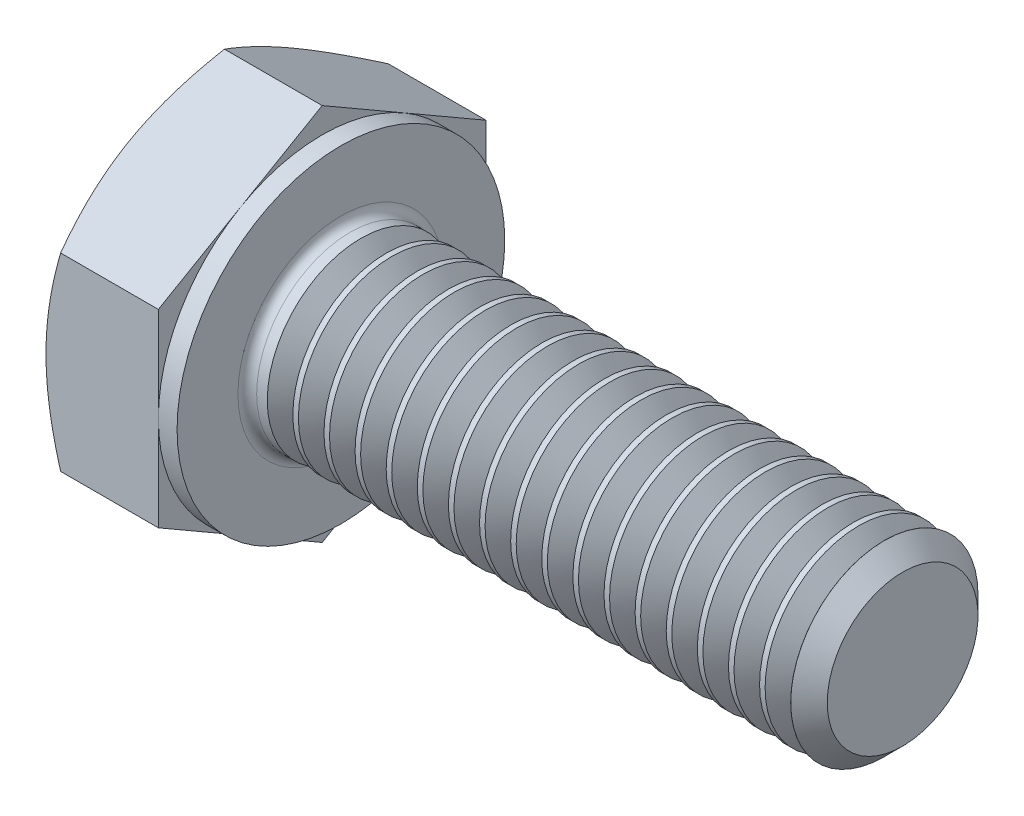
ISO-10303-21;
HEADER;
FILE_DESCRIPTION(('STEP AP214'),'2;1');
FILE_NAME('part.step','',(''),(''),'','','');
FILE_SCHEMA(('AUTOMOTIVE_DESIGN { 1 0 10303 214 1 1 1 1 }'));
ENDSEC;
DATA;
#1=APPLICATION_CONTEXT('core data for automotive mechanical design processes');
#2=APPLICATION_PROTOCOL_DEFINITION('international standard','automotive_design',2000,#1);
#3=PRODUCT_CONTEXT('',#1,'mechanical');
#4=PRODUCT('Part','Part','',(#3));
#5=PRODUCT_RELATED_PRODUCT_CATEGORY('part','',(#4));
#6=PRODUCT_DEFINITION_FORMATION('','',#4);
#7=PRODUCT_DEFINITION_CONTEXT('part definition',#1,'design');
#8=PRODUCT_DEFINITION('design','',#6,#7);
#9=PRODUCT_DEFINITION_SHAPE('','',#8);
#10=(LENGTH_UNIT() NAMED_UNIT(*) SI_UNIT(.MILLI.,.METRE.));
#11=(NAMED_UNIT(*) PLANE_ANGLE_UNIT() SI_UNIT($,.RADIAN.));
#12=(NAMED_UNIT(*) SI_UNIT($,.STERADIAN.) SOLID_ANGLE_UNIT());
#13=UNCERTAINTY_MEASURE_WITH_UNIT(LENGTH_MEASURE(1.E-05),#10,'distance_accuracy_value','');
#14=(GEOMETRIC_REPRESENTATION_CONTEXT(3) GLOBAL_UNCERTAINTY_ASSIGNED_CONTEXT((#13)) GLOBAL_UNIT_ASSIGNED_CONTEXT((#10,
#11,#12)) REPRESENTATION_CONTEXT('',''));
#15=CARTESIAN_POINT('',(0.,0.,0.));
#16=DIRECTION('',(0.,0.,1.));
#17=DIRECTION('',(1.,0.,0.));
#18=AXIS2_PLACEMENT_3D('',#15,#16,#17);
#19=CARTESIAN_POINT('',(2.8,0.,-6.99999999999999));
#20=DIRECTION('',(1.,0.,0.));
#21=DIRECTION('',(0.,0.,-1.));
#22=AXIS2_PLACEMENT_3D('',#19,#20,#21);
#23=PLANE('',#22);
#24=CARTESIAN_POINT('',(2.8,0.,0.));
#25=DIRECTION('',(1.,0.,0.));
#26=DIRECTION('',(0.,0.,-1.));
#27=AXIS2_PLACEMENT_3D('',#24,#25,#26);
#28=CIRCLE('',#27,2.2);
#29=CARTESIAN_POINT('',(2.8,0.,-2.2));
#30=VERTEX_POINT('',#29);
#31=EDGE_CURVE('E43',#30,#30,#28,.F.);
#32=ORIENTED_EDGE('',*,*,#31,.T.);
#33=EDGE_LOOP('',(#32));
#34=FACE_BOUND('',#33,.T.);
#35=CARTESIAN_POINT('',(2.8,0.,0.));
#36=DIRECTION('',(1.,0.,0.));
#37=DIRECTION('',(0.,0.,-1.));
#38=AXIS2_PLACEMENT_3D('',#35,#36,#37);
#39=CIRCLE('',#38,3.5);
#40=CARTESIAN_POINT('',(2.8,0.,-3.5));
#41=VERTEX_POINT('',#40);
#42=EDGE_CURVE('E306',#41,#41,#39,.T.);
#43=ORIENTED_EDGE('',*,*,#42,.T.);
#44=EDGE_LOOP('',(#43));
#45=FACE_BOUND('',#44,.T.);
#46=ADVANCED_FACE('F35',(#34,#45),#23,.T.);
#47=CARTESIAN_POINT('',(0.,0.,0.));
#48=DIRECTION('',(-1.,0.,0.));
#49=DIRECTION('',(0.,0.,1.));
#50=AXIS2_PLACEMENT_3D('',#47,#48,#49);
#51=CYLINDRICAL_SURFACE('',#50,2.);
#52=CARTESIAN_POINT('',(3.22691906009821,0.,0.));
#53=DIRECTION('',(-1.,0.,0.));
#54=DIRECTION('',(0.,-1.,0.));
#55=AXIS2_PLACEMENT_3D('',#52,#53,#54);
#56=CIRCLE('',#55,2.);
#57=CARTESIAN_POINT('',(3.22691906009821,-2.,0.));
#58=VERTEX_POINT('',#57);
#59=EDGE_CURVE('E353',#58,#58,#56,.T.);
#60=ORIENTED_EDGE('',*,*,#59,.T.);
#61=EDGE_LOOP('',(#60));
#62=FACE_BOUND('',#61,.T.);
#63=CARTESIAN_POINT('',(3.,0.,0.));
#64=DIRECTION('',(1.,0.,0.));
#65=DIRECTION('',(0.,0.,-1.));
#66=AXIS2_PLACEMENT_3D('',#63,#64,#65);
#67=CIRCLE('',#66,2.);
#68=CARTESIAN_POINT('',(3.,0.,-2.));
#69=VERTEX_POINT('',#68);
#70=EDGE_CURVE('E11',#69,#69,#67,.T.);
#71=ORIENTED_EDGE('',*,*,#70,.T.);
#72=EDGE_LOOP('',(#71));
#73=FACE_BOUND('',#72,.T.);
#74=ADVANCED_FACE('F255',(#62,#73),#51,.T.);
#75=CARTESIAN_POINT('',(2.4,3.5,0.));
#76=DIRECTION('',(1.,0.,0.));
#77=DIRECTION('',(0.,0.,-1.));
#78=AXIS2_PLACEMENT_3D('',#75,#76,#77);
#79=PLANE('',#78);
#80=DIRECTION('',(0.,0.500000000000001,0.866025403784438));
#81=VECTOR('',#80,1.);
#82=CARTESIAN_POINT('',(2.4,2.02072594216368,-3.5));
#83=LINE('',#82,#81);
#84=CARTESIAN_POINT('',(2.4,2.02072594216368,-3.5));
#85=VERTEX_POINT('',#84);
#86=CARTESIAN_POINT('',(2.4,3.03108891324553,-1.75));
#87=VERTEX_POINT('',#86);
#88=EDGE_CURVE('E168',#85,#87,#83,.T.);
#89=ORIENTED_EDGE('',*,*,#88,.T.);
#90=CARTESIAN_POINT('',(2.4,0.,0.));
#91=DIRECTION('',(-1.,0.,0.));
#92=DIRECTION('',(0.,0.,1.));
#93=AXIS2_PLACEMENT_3D('',#90,#91,#92);
#94=CIRCLE('',#93,3.5);
#95=CARTESIAN_POINT('',(2.4,0.,-3.5));
#96=VERTEX_POINT('',#95);
#97=EDGE_CURVE('E50',#87,#96,#94,.T.);
#98=ORIENTED_EDGE('',*,*,#97,.T.);
#99=DIRECTION('',(0.,1.,0.));
#100=VECTOR('',#99,1.);
#101=CARTESIAN_POINT('',(2.4,2.02072594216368,-3.5));
#102=LINE('',#101,#100);
#103=EDGE_CURVE('E309',#96,#85,#102,.T.);
#104=ORIENTED_EDGE('',*,*,#103,.T.);
#105=EDGE_LOOP('',(#89,#98,#104));
#106=FACE_BOUND('',#105,.T.);
#107=ADVANCED_FACE('F260',(#106),#79,.T.);
#108=CARTESIAN_POINT('',(2.4,4.04145188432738,0.));
#109=VERTEX_POINT('',#108);
#110=EDGE_CURVE('E166',#87,#109,#83,.T.);
#111=ORIENTED_EDGE('',*,*,#110,.T.);
#112=DIRECTION('',(0.,-0.499999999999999,0.866025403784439));
#113=VECTOR('',#112,1.);
#114=CARTESIAN_POINT('',(2.4,4.04145188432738,0.));
#115=LINE('',#114,#113);
#116=CARTESIAN_POINT('',(2.4,3.03108891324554,1.75));
#117=VERTEX_POINT('',#116);
#118=EDGE_CURVE('E165',#109,#117,#115,.T.);
#119=ORIENTED_EDGE('',*,*,#118,.T.);
#120=EDGE_CURVE('E154',#117,#87,#94,.T.);
#121=ORIENTED_EDGE('',*,*,#120,.T.);
#122=EDGE_LOOP('',(#111,#119,#121));
#123=FACE_BOUND('',#122,.T.);
#124=ADVANCED_FACE('F329',(#123),#79,.T.);
#125=CARTESIAN_POINT('',(2.4,2.0207259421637,3.49999999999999));
#126=VERTEX_POINT('',#125);
#127=EDGE_CURVE('E132',#117,#126,#115,.T.);
#128=ORIENTED_EDGE('',*,*,#127,.T.);
#129=DIRECTION('',(0.,-1.,0.));
#130=VECTOR('',#129,1.);
#131=CARTESIAN_POINT('',(2.4,2.0207259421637,3.49999999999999));
#132=LINE('',#131,#130);
#133=CARTESIAN_POINT('',(2.4,0.,3.5));
#134=VERTEX_POINT('',#133);
#135=EDGE_CURVE('E126',#126,#134,#132,.T.);
#136=ORIENTED_EDGE('',*,*,#135,.T.);
#137=EDGE_CURVE('E130',#134,#117,#94,.T.);
#138=ORIENTED_EDGE('',*,*,#137,.T.);
#139=EDGE_LOOP('',(#128,#136,#138));
#140=FACE_BOUND('',#139,.T.);
#141=ADVANCED_FACE('F128',(#140),#79,.T.);
#142=CARTESIAN_POINT('',(2.4,-2.02072594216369,3.5));
#143=VERTEX_POINT('',#142);
#144=EDGE_CURVE('E136',#134,#143,#132,.T.);
#145=ORIENTED_EDGE('',*,*,#144,.T.);
#146=DIRECTION('',(0.,-0.500000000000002,-0.866025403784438));
#147=VECTOR('',#146,1.);
#148=CARTESIAN_POINT('',(2.4,-4.04145188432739,0.));
#149=LINE('',#148,#147);
#150=CARTESIAN_POINT('',(2.4,-3.03108891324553,1.75000000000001));
#151=VERTEX_POINT('',#150);
#152=EDGE_CURVE('E143',#143,#151,#149,.T.);
#153=ORIENTED_EDGE('',*,*,#152,.T.);
#154=EDGE_CURVE('E140',#151,#134,#94,.T.);
#155=ORIENTED_EDGE('',*,*,#154,.T.);
#156=EDGE_LOOP('',(#145,#153,#155));
#157=FACE_BOUND('',#156,.T.);
#158=ADVANCED_FACE('F141',(#157),#79,.T.);
#159=CARTESIAN_POINT('',(2.4,-4.04145188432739,0.));
#160=VERTEX_POINT('',#159);
#161=EDGE_CURVE('E160',#151,#160,#149,.T.);
#162=ORIENTED_EDGE('',*,*,#161,.T.);
#163=DIRECTION('',(0.,0.500000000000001,-0.866025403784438));
#164=VECTOR('',#163,1.);
#165=CARTESIAN_POINT('',(2.4,-2.0207259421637,-3.5));
#166=LINE('',#165,#164);
#167=CARTESIAN_POINT('',(2.4,-3.03108891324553,-1.75));
#168=VERTEX_POINT('',#167);
#169=EDGE_CURVE('E349',#160,#168,#166,.T.);
#170=ORIENTED_EDGE('',*,*,#169,.T.);
#171=EDGE_CURVE('E147',#168,#151,#94,.T.);
#172=ORIENTED_EDGE('',*,*,#171,.T.);
#173=EDGE_LOOP('',(#162,#170,#172));
#174=FACE_BOUND('',#173,.T.);
#175=ADVANCED_FACE('F750',(#174),#79,.T.);
#176=CARTESIAN_POINT('',(2.4,-2.0207259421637,-3.5));
#177=VERTEX_POINT('',#176);
#178=EDGE_CURVE('E155',#168,#177,#166,.T.);
#179=ORIENTED_EDGE('',*,*,#178,.T.);
#180=EDGE_CURVE('E310',#177,#96,#102,.T.);
#181=ORIENTED_EDGE('',*,*,#180,.T.);
#182=EDGE_CURVE('E318',#96,#168,#94,.T.);
#183=ORIENTED_EDGE('',*,*,#182,.T.);
#184=EDGE_LOOP('',(#179,#181,#183));
#185=FACE_BOUND('',#184,.T.);
#186=ADVANCED_FACE('F317',(#185),#79,.T.);
#187=CARTESIAN_POINT('',(0.,0.,0.));
#188=DIRECTION('',(-1.,0.,0.));
#189=DIRECTION('',(0.,0.,1.));
#190=AXIS2_PLACEMENT_3D('',#187,#188,#189);
#191=CYLINDRICAL_SURFACE('',#190,3.5);
#192=ORIENTED_EDGE('',*,*,#97,.F.);
#193=ORIENTED_EDGE('',*,*,#120,.F.);
#194=ORIENTED_EDGE('',*,*,#137,.F.);
#195=ORIENTED_EDGE('',*,*,#154,.F.);
#196=ORIENTED_EDGE('',*,*,#171,.F.);
#197=ORIENTED_EDGE('',*,*,#182,.F.);
#198=EDGE_LOOP('',(#192,#193,#194,#195,#196,#197));
#199=FACE_BOUND('',#198,.T.);
#200=ORIENTED_EDGE('',*,*,#42,.F.);
#201=EDGE_LOOP('',(#200));
#202=FACE_BOUND('',#201,.T.);
#203=ADVANCED_FACE('F151',(#199,#202),#191,.T.);
#204=CARTESIAN_POINT('',(0.,0.,-6.99999999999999));
#205=DIRECTION('',(1.,0.,0.));
#206=DIRECTION('',(0.,0.,-1.));
#207=AXIS2_PLACEMENT_3D('',#204,#205,#206);
#208=PLANE('',#207);
#209=CARTESIAN_POINT('',(0.,0.,0.));
#210=DIRECTION('',(1.,0.,0.));
#211=DIRECTION('',(0.,0.,-1.));
#212=AXIS2_PLACEMENT_3D('',#209,#210,#211);
#213=CIRCLE('',#212,3.5);
#214=CARTESIAN_POINT('',(0.,0.,-3.5));
#215=VERTEX_POINT('',#214);
#216=CARTESIAN_POINT('',(0.,3.03108891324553,-1.75));
#217=VERTEX_POINT('',#216);
#218=EDGE_CURVE('E305',#215,#217,#213,.T.);
#219=ORIENTED_EDGE('',*,*,#218,.F.);
#220=CARTESIAN_POINT('',(0.,-3.03108891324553,-1.75));
#221=VERTEX_POINT('',#220);
#222=EDGE_CURVE('E301',#221,#215,#213,.T.);
#223=ORIENTED_EDGE('',*,*,#222,.F.);
#224=CARTESIAN_POINT('',(0.,-3.03108891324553,1.75000000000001));
#225=VERTEX_POINT('',#224);
#226=EDGE_CURVE('E304',#225,#221,#213,.T.);
#227=ORIENTED_EDGE('',*,*,#226,.F.);
#228=CARTESIAN_POINT('',(0.,0.,3.5));
#229=VERTEX_POINT('',#228);
#230=EDGE_CURVE('E342',#229,#225,#213,.T.);
#231=ORIENTED_EDGE('',*,*,#230,.F.);
#232=CARTESIAN_POINT('',(0.,0.,0.));
#233=DIRECTION('',(-1.,0.,0.));
#234=DIRECTION('',(0.,0.,1.));
#235=AXIS2_PLACEMENT_3D('',#232,#233,#234);
#236=CIRCLE('',#235,3.5);
#237=CARTESIAN_POINT('',(0.,3.03108891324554,1.75));
#238=VERTEX_POINT('',#237);
#239=EDGE_CURVE('E169',#229,#238,#236,.T.);
#240=ORIENTED_EDGE('',*,*,#239,.T.);
#241=EDGE_CURVE('E1195',#217,#238,#213,.T.);
#242=ORIENTED_EDGE('',*,*,#241,.F.);
#243=EDGE_LOOP('',(#219,#223,#227,#231,#240,#242));
#244=FACE_BOUND('',#243,.T.);
#245=ADVANCED_FACE('F200',(#244),#208,.F.);
#246=CARTESIAN_POINT('',(0.,0.,0.));
#247=DIRECTION('',(1.,0.,0.));
#248=DIRECTION('',(0.,0.,-1.));
#249=AXIS2_PLACEMENT_3D('',#246,#247,#248);
#250=CONICAL_SURFACE('',#249,3.5,1.0471975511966);
#251=CARTESIAN_POINT('',(0.312674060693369,2.02061047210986,3.50019999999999));
#252=CARTESIAN_POINT('',(0.261385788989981,2.10941108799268,3.34639282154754));
#253=CARTESIAN_POINT('',(0.214740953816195,2.1989782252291,3.19125798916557));
#254=CARTESIAN_POINT('',(0.133321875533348,2.37966345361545,2.87830199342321));
#255=CARTESIAN_POINT('',(0.0985764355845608,2.47078475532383,2.7204752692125));
#256=CARTESIAN_POINT('',(0.044490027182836,2.65189807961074,2.40677778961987));
#257=CARTESIAN_POINT('',(0.0247890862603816,2.741862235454,2.2509553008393));
#258=CARTESIAN_POINT('',(0.0012701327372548,2.92221386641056,1.93857711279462));
#259=CARTESIAN_POINT('',(-0.00256735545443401,3.01260068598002,1.78202254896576));
#260=CARTESIAN_POINT('',(0.00541530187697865,3.1814939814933,1.48949078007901));
#261=CARTESIAN_POINT('',(0.015275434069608,3.26002573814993,1.35346978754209));
#262=CARTESIAN_POINT('',(0.0465264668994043,3.41657761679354,1.082313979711));
#263=CARTESIAN_POINT('',(0.0679280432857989,3.49459719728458,0.947180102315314));
#264=CARTESIAN_POINT('',(0.121430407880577,3.65147186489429,0.675465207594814));
#265=CARTESIAN_POINT('',(0.153757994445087,3.73030709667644,0.538918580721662));
#266=CARTESIAN_POINT('',(0.227128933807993,3.88680174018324,0.267861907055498));
#267=CARTESIAN_POINT('',(0.268155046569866,3.96446315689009,0.133348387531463));
#268=CARTESIAN_POINT('',(0.312674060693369,4.04156735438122,-0.000200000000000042));
#269=B_SPLINE_CURVE_WITH_KNOTS('',3,(#251,#252,#253,#254,#255,#256,#257,#258,#259,#260,#261,
#262,#263,#264,#265,#266,#267,#268),.UNSPECIFIED.,.F.,.F.,(4,2,2,2,2,2,2,2,4),(0.,
0.554793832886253,1.11092123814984,1.65328467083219,2.19498204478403,2.6666513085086,
3.13875761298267,3.62133612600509,4.10296698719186),.UNSPECIFIED.);
#270=CARTESIAN_POINT('',(0.312607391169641,4.04145188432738,0.));
#271=VERTEX_POINT('',#270);
#272=EDGE_CURVE('E220',#238,#271,#269,.T.);
#273=ORIENTED_EDGE('',*,*,#272,.T.);
#274=CARTESIAN_POINT('',(0.312674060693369,4.04156735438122,0.0002));
#275=CARTESIAN_POINT('',(0.261385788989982,3.9527667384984,-0.15360717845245));
#276=CARTESIAN_POINT('',(0.214740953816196,3.86319960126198,-0.308742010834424));
#277=CARTESIAN_POINT('',(0.133321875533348,3.68251437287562,-0.621698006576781));
#278=CARTESIAN_POINT('',(0.0985764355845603,3.59139307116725,-0.779524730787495));
#279=CARTESIAN_POINT('',(0.044490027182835,3.41027974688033,-1.09322221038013));
#280=CARTESIAN_POINT('',(0.0247890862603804,3.32031559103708,-1.24904469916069));
#281=CARTESIAN_POINT('',(0.00127013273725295,3.13996396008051,-1.56142288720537));
#282=CARTESIAN_POINT('',(-0.00256735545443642,3.04957714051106,-1.71797745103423));
#283=CARTESIAN_POINT('',(0.00541530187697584,2.88068384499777,-2.01050921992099));
#284=CARTESIAN_POINT('',(0.0152754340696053,2.80215208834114,-2.1465302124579));
#285=CARTESIAN_POINT('',(0.0465264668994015,2.64560020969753,-2.41768602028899));
#286=CARTESIAN_POINT('',(0.067928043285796,2.56758062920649,-2.55281989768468));
#287=CARTESIAN_POINT('',(0.121430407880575,2.41070596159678,-2.82453479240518));
#288=CARTESIAN_POINT('',(0.153757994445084,2.33187072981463,-2.96108141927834));
#289=CARTESIAN_POINT('',(0.227128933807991,2.17537608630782,-3.2321380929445));
#290=CARTESIAN_POINT('',(0.268155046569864,2.09771466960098,-3.36665161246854));
#291=CARTESIAN_POINT('',(0.312674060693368,2.02061047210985,-3.5002));
#292=B_SPLINE_CURVE_WITH_KNOTS('',3,(#274,#275,#276,#277,#278,#279,#280,#281,#282,#283,#284,
#285,#286,#287,#288,#289,#290,#291),.UNSPECIFIED.,.F.,.F.,(4,2,2,2,2,2,2,2,4),(0.,
0.554793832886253,1.11092123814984,1.65328467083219,2.19498204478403,2.6666513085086,
3.13875761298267,3.6213361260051,4.10296698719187),.UNSPECIFIED.);
#293=EDGE_CURVE('E58',#271,#217,#292,.T.);
#294=ORIENTED_EDGE('',*,*,#293,.T.);
#295=ORIENTED_EDGE('',*,*,#241,.T.);
#296=EDGE_LOOP('',(#273,#294,#295));
#297=FACE_BOUND('',#296,.T.);
#298=ADVANCED_FACE('F780',(#297),#250,.T.);
#299=CARTESIAN_POINT('',(1.74876972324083,-5.51155991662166,3.50000000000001));
#300=CARTESIAN_POINT('',(1.6739233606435,-5.35795146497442,3.50000000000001));
#301=CARTESIAN_POINT('',(1.59977092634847,-5.20399921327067,3.5));
#302=CARTESIAN_POINT('',(1.45324265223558,-4.89522455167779,3.5));
#303=CARTESIAN_POINT('',(1.38086707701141,-4.74040201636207,3.5));
#304=CARTESIAN_POINT('',(1.23793493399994,-4.42894615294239,3.5));
#305=CARTESIAN_POINT('',(1.1673897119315,-4.27230760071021,3.5));
#306=CARTESIAN_POINT('',(1.02907715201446,-3.95781335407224,3.5));
#307=CARTESIAN_POINT('',(0.961309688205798,-3.7999577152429,3.5));
#308=CARTESIAN_POINT('',(0.827049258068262,-3.47741113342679,3.5));
#309=CARTESIAN_POINT('',(0.760677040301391,-3.31266966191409,3.5));
#310=CARTESIAN_POINT('',(0.632756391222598,-2.98129055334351,3.5));
#311=CARTESIAN_POINT('',(0.571208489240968,-2.81465271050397,3.5));
#312=CARTESIAN_POINT('',(0.454490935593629,-2.47950135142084,3.5));
#313=CARTESIAN_POINT('',(0.399309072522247,-2.31099212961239,3.5));
#314=CARTESIAN_POINT('',(0.297038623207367,-1.97155788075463,3.5));
#315=CARTESIAN_POINT('',(0.249947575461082,-1.80063360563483,3.5));
#316=CARTESIAN_POINT('',(0.166312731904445,-1.4572176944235,3.5));
#317=CARTESIAN_POINT('',(0.129709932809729,-1.28474069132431,3.5));
#318=CARTESIAN_POINT('',(0.0690664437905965,-0.937557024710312,3.5));
#319=CARTESIAN_POINT('',(0.0450243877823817,-0.762850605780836,3.5));
#320=CARTESIAN_POINT('',(0.0117307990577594,-0.414396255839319,3.5));
#321=CARTESIAN_POINT('',(0.002282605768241,-0.240667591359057,3.5));
#322=CARTESIAN_POINT('',(-0.00154556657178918,0.10697436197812,3.5));
#323=CARTESIAN_POINT('',(0.00407467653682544,0.280887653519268,3.5));
#324=CARTESIAN_POINT('',(0.0258160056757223,0.573677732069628,3.5));
#325=CARTESIAN_POINT('',(0.0381294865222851,0.692856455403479,3.5));
#326=CARTESIAN_POINT('',(0.0691104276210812,0.930390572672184,3.5));
#327=CARTESIAN_POINT('',(0.0877786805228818,1.04874586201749,3.5));
#328=CARTESIAN_POINT('',(0.152339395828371,1.40238821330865,3.5));
#329=CARTESIAN_POINT('',(0.20677796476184,1.63613518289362,3.5));
#330=CARTESIAN_POINT('',(0.301818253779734,1.98584040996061,3.49999999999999));
#331=CARTESIAN_POINT('',(0.336200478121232,2.10359260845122,3.49999999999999));
#332=CARTESIAN_POINT('',(0.408694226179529,2.33795453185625,3.49999999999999));
#333=CARTESIAN_POINT('',(0.446805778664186,2.45456424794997,3.49999999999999));
#334=CARTESIAN_POINT('',(0.526133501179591,2.68667648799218,3.49999999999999));
#335=CARTESIAN_POINT('',(0.5673487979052,2.80217931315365,3.49999999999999));
#336=CARTESIAN_POINT('',(0.652383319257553,3.03221622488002,3.49999999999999));
#337=CARTESIAN_POINT('',(0.69620248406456,3.14675033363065,3.49999999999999));
#338=CARTESIAN_POINT('',(0.81758642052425,3.45518824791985,3.49999999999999));
#339=CARTESIAN_POINT('',(0.897216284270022,3.64827858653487,3.49999999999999));
#340=CARTESIAN_POINT('',(1.06116121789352,4.03246734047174,3.49999999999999));
#341=CARTESIAN_POINT('',(1.1454768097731,4.22356553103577,3.49999999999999));
#342=CARTESIAN_POINT('',(1.31768022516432,4.60422080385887,3.49999999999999));
#343=CARTESIAN_POINT('',(1.40556928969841,4.79377732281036,3.49999999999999));
#344=CARTESIAN_POINT('',(1.58407294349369,5.17160543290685,3.49999999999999));
#345=CARTESIAN_POINT('',(1.67468761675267,5.35987698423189,3.49999999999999));
#346=CARTESIAN_POINT('',(1.85818750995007,5.73567568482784,3.49999999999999));
#347=CARTESIAN_POINT('',(1.95107608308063,5.92320119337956,3.49999999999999));
#348=CARTESIAN_POINT('',(2.13854805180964,6.29740401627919,3.49999999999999));
#349=CARTESIAN_POINT('',(2.23313146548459,6.48408132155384,3.49999999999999));
#350=CARTESIAN_POINT('',(2.51886265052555,7.04299370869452,3.49999999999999));
#351=CARTESIAN_POINT('',(2.71203324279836,7.41419418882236,3.49999999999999));
#352=CARTESIAN_POINT('',(3.08131090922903,8.11545297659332,3.49999999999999));
#353=CARTESIAN_POINT('',(3.257056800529,8.44570240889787,3.49999999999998));
#354=CARTESIAN_POINT('',(3.61066708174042,9.10509095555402,3.49999999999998));
#355=CARTESIAN_POINT('',(3.78853160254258,9.43422999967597,3.49999999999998));
#356=CARTESIAN_POINT('',(4.14522643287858,10.0905480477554,3.49999999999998));
#357=CARTESIAN_POINT('',(4.32405147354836,10.4177299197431,3.49999999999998));
#358=CARTESIAN_POINT('',(4.68290305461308,11.0714005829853,3.49999999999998));
#359=CARTESIAN_POINT('',(4.8629294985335,11.3978894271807,3.49999999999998));
#360=CARTESIAN_POINT('',(5.04339321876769,11.7241348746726,3.49999999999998));
#361=B_SPLINE_CURVE_WITH_KNOTS('',3,(#299,#300,#301,#302,#303,#304,#305,#306,#307,#308,#309,
#310,#311,#312,#313,#314,#315,#316,#317,#318,#319,#320,#321,#322,#323,#324,#325,#326,#327,#328,
#329,#330,#331,#332,#333,#334,#335,#336,#337,#338,#339,#340,#341,#342,#343,#344,#345,#346,#347,
#348,#349,#350,#351,#352,#353,#354,#355,#356,#357,#358,#359,#360),.UNSPECIFIED.,.F.,.F.,(4,2,2,
2,2,2,2,2,2,2,2,2,2,2,2,2,2,2,2,2,2,2,2,2,2,2,2,2,2,2,4),(0.,0.512624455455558,1.02532478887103,
1.54067716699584,2.05600615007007,2.58877526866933,3.12160276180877,3.65339055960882,
4.18501628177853,4.71358975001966,5.24210571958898,5.76343550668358,6.28477297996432,
6.64403977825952,7.00335140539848,7.72232402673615,8.09029790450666,8.45827462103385,
8.82614818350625,9.19401329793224,9.82051720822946,10.4470910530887,11.0738843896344,
11.7006970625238,12.3284975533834,12.9563047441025,14.211635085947,15.3339292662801,
16.4562931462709,17.574877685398,18.6933734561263),.UNSPECIFIED.);
#362=CARTESIAN_POINT('',(0.312607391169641,2.0207259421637,3.49999999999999));
#363=VERTEX_POINT('',#362);
#364=EDGE_CURVE('E234',#229,#363,#361,.T.);
#365=ORIENTED_EDGE('',*,*,#364,.T.);
#366=EDGE_CURVE('E233',#363,#238,#269,.T.);
#367=ORIENTED_EDGE('',*,*,#366,.T.);
#368=ORIENTED_EDGE('',*,*,#239,.F.);
#369=EDGE_LOOP('',(#365,#367,#368));
#370=FACE_BOUND('',#369,.T.);
#371=ADVANCED_FACE('F336',(#370),#250,.T.);
#372=CARTESIAN_POINT('',(0.312607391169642,-2.02072594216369,3.5));
#373=VERTEX_POINT('',#372);
#374=EDGE_CURVE('E286',#373,#229,#361,.T.);
#375=ORIENTED_EDGE('',*,*,#374,.T.);
#376=ORIENTED_EDGE('',*,*,#230,.T.);
#377=CARTESIAN_POINT('',(0.312674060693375,-4.04156735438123,-0.000200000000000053));
#378=CARTESIAN_POINT('',(0.261385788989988,-3.95276673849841,0.15360717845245));
#379=CARTESIAN_POINT('',(0.214740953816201,-3.86319960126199,0.308742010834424));
#380=CARTESIAN_POINT('',(0.133321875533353,-3.68251437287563,0.621698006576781));
#381=CARTESIAN_POINT('',(0.0985764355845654,-3.59139307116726,0.779524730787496));
#382=CARTESIAN_POINT('',(0.0444900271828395,-3.41027974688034,1.09322221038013));
#383=CARTESIAN_POINT('',(0.0247890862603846,-3.32031559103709,1.24904469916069));
#384=CARTESIAN_POINT('',(0.00127013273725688,-3.13996396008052,1.56142288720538));
#385=CARTESIAN_POINT('',(-0.00256735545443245,-3.04957714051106,1.71797745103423));
#386=CARTESIAN_POINT('',(0.00541530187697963,-2.88068384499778,2.01050921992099));
#387=CARTESIAN_POINT('',(0.0152754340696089,-2.80215208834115,2.14653021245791));
#388=CARTESIAN_POINT('',(0.0465264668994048,-2.64560020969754,2.417686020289));
#389=CARTESIAN_POINT('',(0.0679280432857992,-2.5675806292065,2.55281989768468));
#390=CARTESIAN_POINT('',(0.121430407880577,-2.41070596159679,2.82453479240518));
#391=CARTESIAN_POINT('',(0.153757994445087,-2.33187072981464,2.96108141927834));
#392=CARTESIAN_POINT('',(0.227128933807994,-2.17537608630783,3.2321380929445));
#393=CARTESIAN_POINT('',(0.268155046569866,-2.09771466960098,3.36665161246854));
#394=CARTESIAN_POINT('',(0.31267406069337,-2.02061047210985,3.5002));
#395=B_SPLINE_CURVE_WITH_KNOTS('',3,(#377,#378,#379,#380,#381,#382,#383,#384,#385,#386,#387,
#388,#389,#390,#391,#392,#393,#394),.UNSPECIFIED.,.F.,.F.,(4,2,2,2,2,2,2,2,4),(0.,
0.554793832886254,1.11092123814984,1.65328467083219,2.19498204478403,2.6666513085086,
3.13875761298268,3.6213361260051,4.10296698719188),.UNSPECIFIED.);
#396=EDGE_CURVE('E222',#225,#373,#395,.T.);
#397=ORIENTED_EDGE('',*,*,#396,.T.);
#398=EDGE_LOOP('',(#375,#376,#397));
#399=FACE_BOUND('',#398,.T.);
#400=ADVANCED_FACE('F189',(#399),#250,.T.);
#401=CARTESIAN_POINT('',(0.312607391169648,-4.04145188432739,0.));
#402=VERTEX_POINT('',#401);
#403=EDGE_CURVE('E214',#402,#225,#395,.T.);
#404=ORIENTED_EDGE('',*,*,#403,.T.);
#405=ORIENTED_EDGE('',*,*,#226,.T.);
#406=CARTESIAN_POINT('',(0.312674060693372,-2.02061047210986,-3.5002));
#407=CARTESIAN_POINT('',(0.261385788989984,-2.10941108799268,-3.34639282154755));
#408=CARTESIAN_POINT('',(0.214740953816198,-2.1989782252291,-3.19125798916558));
#409=CARTESIAN_POINT('',(0.133321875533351,-2.37966345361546,-2.87830199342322));
#410=CARTESIAN_POINT('',(0.0985764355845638,-2.47078475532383,-2.7204752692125));
#411=CARTESIAN_POINT('',(0.0444900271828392,-2.65189807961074,-2.40677778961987));
#412=CARTESIAN_POINT('',(0.024789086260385,-2.741862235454,-2.25095530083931));
#413=CARTESIAN_POINT('',(0.00127013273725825,-2.92221386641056,-1.93857711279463));
#414=CARTESIAN_POINT('',(-0.00256735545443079,-3.01260068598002,-1.78202254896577));
#415=CARTESIAN_POINT('',(0.00541530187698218,-3.18149398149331,-1.48949078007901));
#416=CARTESIAN_POINT('',(0.015275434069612,-3.26002573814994,-1.35346978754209));
#417=CARTESIAN_POINT('',(0.0465264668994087,-3.41657761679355,-1.08231397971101));
#418=CARTESIAN_POINT('',(0.0679280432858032,-3.49459719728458,-0.947180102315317));
#419=CARTESIAN_POINT('',(0.121430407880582,-3.6514718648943,-0.675465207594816));
#420=CARTESIAN_POINT('',(0.153757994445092,-3.73030709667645,-0.538918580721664));
#421=CARTESIAN_POINT('',(0.227128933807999,-3.88680174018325,-0.267861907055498));
#422=CARTESIAN_POINT('',(0.268155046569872,-3.9644631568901,-0.133348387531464));
#423=CARTESIAN_POINT('',(0.312674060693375,-4.04156735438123,0.000199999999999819));
#424=B_SPLINE_CURVE_WITH_KNOTS('',3,(#406,#407,#408,#409,#410,#411,#412,#413,#414,#415,#416,
#417,#418,#419,#420,#421,#422,#423),.UNSPECIFIED.,.F.,.F.,(4,2,2,2,2,2,2,2,4),(0.,
0.554793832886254,1.11092123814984,1.65328467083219,2.19498204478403,2.6666513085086,
3.13875761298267,3.6213361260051,4.10296698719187),.UNSPECIFIED.);
#425=EDGE_CURVE('E221',#221,#402,#424,.T.);
#426=ORIENTED_EDGE('',*,*,#425,.T.);
#427=EDGE_LOOP('',(#404,#405,#426));
#428=FACE_BOUND('',#427,.T.);
#429=ADVANCED_FACE('F793',(#428),#250,.T.);
#430=CARTESIAN_POINT('',(0.31260739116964,2.02072594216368,-3.5));
#431=VERTEX_POINT('',#430);
#432=EDGE_CURVE('E223',#217,#431,#292,.T.);
#433=ORIENTED_EDGE('',*,*,#432,.T.);
#434=CARTESIAN_POINT('',(1.74876972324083,-5.51155991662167,-3.5));
#435=CARTESIAN_POINT('',(1.6739233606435,-5.35795146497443,-3.5));
#436=CARTESIAN_POINT('',(1.59977092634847,-5.20399921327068,-3.5));
#437=CARTESIAN_POINT('',(1.45324265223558,-4.8952245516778,-3.5));
#438=CARTESIAN_POINT('',(1.38086707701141,-4.74040201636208,-3.5));
#439=CARTESIAN_POINT('',(1.23793493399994,-4.4289461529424,-3.5));
#440=CARTESIAN_POINT('',(1.1673897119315,-4.27230760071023,-3.5));
#441=CARTESIAN_POINT('',(1.02907715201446,-3.95781335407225,-3.5));
#442=CARTESIAN_POINT('',(0.961309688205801,-3.79995771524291,-3.5));
#443=CARTESIAN_POINT('',(0.827049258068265,-3.4774111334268,-3.5));
#444=CARTESIAN_POINT('',(0.760677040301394,-3.3126696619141,-3.5));
#445=CARTESIAN_POINT('',(0.632756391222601,-2.98129055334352,-3.5));
#446=CARTESIAN_POINT('',(0.571208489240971,-2.81465271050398,-3.5));
#447=CARTESIAN_POINT('',(0.454490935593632,-2.47950135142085,-3.5));
#448=CARTESIAN_POINT('',(0.399309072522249,-2.3109921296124,-3.5));
#449=CARTESIAN_POINT('',(0.297038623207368,-1.97155788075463,-3.5));
#450=CARTESIAN_POINT('',(0.249947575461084,-1.80063360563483,-3.5));
#451=CARTESIAN_POINT('',(0.166312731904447,-1.45721769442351,-3.5));
#452=CARTESIAN_POINT('',(0.129709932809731,-1.28474069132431,-3.5));
#453=CARTESIAN_POINT('',(0.0690664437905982,-0.937557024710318,-3.5));
#454=CARTESIAN_POINT('',(0.0450243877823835,-0.762850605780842,-3.5));
#455=CARTESIAN_POINT('',(0.011730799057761,-0.414396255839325,-3.5));
#456=CARTESIAN_POINT('',(0.00228260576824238,-0.240667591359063,-3.5));
#457=CARTESIAN_POINT('',(-0.00154556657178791,0.106974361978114,-3.5));
#458=CARTESIAN_POINT('',(0.00407467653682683,0.280887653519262,-3.5));
#459=CARTESIAN_POINT('',(0.0258160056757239,0.573677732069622,-3.5));
#460=CARTESIAN_POINT('',(0.0381294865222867,0.692856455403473,-3.5));
#461=CARTESIAN_POINT('',(0.0691104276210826,0.930390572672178,-3.5));
#462=CARTESIAN_POINT('',(0.087778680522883,1.04874586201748,-3.5));
#463=CARTESIAN_POINT('',(0.152339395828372,1.40238821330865,-3.5));
#464=CARTESIAN_POINT('',(0.206777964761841,1.63613518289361,-3.5));
#465=CARTESIAN_POINT('',(0.301818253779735,1.9858404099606,-3.5));
#466=CARTESIAN_POINT('',(0.336200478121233,2.10359260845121,-3.5));
#467=CARTESIAN_POINT('',(0.408694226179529,2.33795453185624,-3.5));
#468=CARTESIAN_POINT('',(0.446805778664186,2.45456424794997,-3.5));
#469=CARTESIAN_POINT('',(0.526133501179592,2.68667648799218,-3.5));
#470=CARTESIAN_POINT('',(0.567348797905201,2.80217931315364,-3.5));
#471=CARTESIAN_POINT('',(0.652383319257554,3.03221622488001,-3.5));
#472=CARTESIAN_POINT('',(0.69620248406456,3.14675033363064,-3.5));
#473=CARTESIAN_POINT('',(0.81758642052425,3.45518824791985,-3.5));
#474=CARTESIAN_POINT('',(0.897216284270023,3.64827858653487,-3.5));
#475=CARTESIAN_POINT('',(1.06116121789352,4.03246734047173,-3.5));
#476=CARTESIAN_POINT('',(1.1454768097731,4.22356553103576,-3.5));
#477=CARTESIAN_POINT('',(1.31768022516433,4.60422080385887,-3.5));
#478=CARTESIAN_POINT('',(1.40556928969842,4.79377732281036,-3.5));
#479=CARTESIAN_POINT('',(1.5840729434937,5.17160543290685,-3.5));
#480=CARTESIAN_POINT('',(1.67468761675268,5.35987698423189,-3.5));
#481=CARTESIAN_POINT('',(1.85818750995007,5.73567568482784,-3.5));
#482=CARTESIAN_POINT('',(1.95107608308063,5.92320119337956,-3.5));
#483=CARTESIAN_POINT('',(2.13854805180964,6.29740401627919,-3.5));
#484=CARTESIAN_POINT('',(2.23313146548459,6.48408132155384,-3.5));
#485=CARTESIAN_POINT('',(2.51886265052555,7.04299370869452,-3.5));
#486=CARTESIAN_POINT('',(2.71203324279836,7.41419418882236,-3.5));
#487=CARTESIAN_POINT('',(3.08131090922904,8.11545297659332,-3.5));
#488=CARTESIAN_POINT('',(3.257056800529,8.44570240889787,-3.5));
#489=CARTESIAN_POINT('',(3.61066708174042,9.10509095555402,-3.5));
#490=CARTESIAN_POINT('',(3.78853160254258,9.43422999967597,-3.5));
#491=CARTESIAN_POINT('',(4.14522643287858,10.0905480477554,-3.5));
#492=CARTESIAN_POINT('',(4.32405147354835,10.4177299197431,-3.5));
#493=CARTESIAN_POINT('',(4.68290305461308,11.0714005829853,-3.5));
#494=CARTESIAN_POINT('',(4.86292949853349,11.3978894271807,-3.5));
#495=CARTESIAN_POINT('',(5.04339321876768,11.7241348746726,-3.5));
#496=B_SPLINE_CURVE_WITH_KNOTS('',3,(#434,#435,#436,#437,#438,#439,#440,#441,#442,#443,#444,
#445,#446,#447,#448,#449,#450,#451,#452,#453,#454,#455,#456,#457,#458,#459,#460,#461,#462,#463,
#464,#465,#466,#467,#468,#469,#470,#471,#472,#473,#474,#475,#476,#477,#478,#479,#480,#481,#482,
#483,#484,#485,#486,#487,#488,#489,#490,#491,#492,#493,#494,#495),.UNSPECIFIED.,.F.,.F.,(4,2,2,
2,2,2,2,2,2,2,2,2,2,2,2,2,2,2,2,2,2,2,2,2,2,2,2,2,2,2,4),(0.,0.512624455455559,1.02532478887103,
1.54067716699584,2.05600615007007,2.58877526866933,3.12160276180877,3.65339055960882,
4.18501628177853,4.71358975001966,5.24210571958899,5.76343550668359,6.28477297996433,
6.64403977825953,7.00335140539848,7.72232402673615,8.09029790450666,8.45827462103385,
8.82614818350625,9.19401329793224,9.82051720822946,10.4470910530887,11.0738843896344,
11.7006970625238,12.3284975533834,12.9563047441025,14.211635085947,15.3339292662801,
16.4562931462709,17.574877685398,18.6933734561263),.UNSPECIFIED.);
#497=EDGE_CURVE('E181',#431,#215,#496,.F.);
#498=ORIENTED_EDGE('',*,*,#497,.T.);
#499=ORIENTED_EDGE('',*,*,#218,.T.);
#500=EDGE_LOOP('',(#433,#498,#499));
#501=FACE_BOUND('',#500,.T.);
#502=ADVANCED_FACE('F788',(#501),#250,.T.);
#503=CARTESIAN_POINT('',(0.312607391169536,-2.02072594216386,-3.5));
#504=VERTEX_POINT('',#503);
#505=EDGE_CURVE('E182',#504,#221,#424,.T.);
#506=ORIENTED_EDGE('',*,*,#505,.T.);
#507=ORIENTED_EDGE('',*,*,#222,.T.);
#508=EDGE_CURVE('E172',#215,#504,#496,.F.);
#509=ORIENTED_EDGE('',*,*,#508,.T.);
#510=EDGE_LOOP('',(#506,#507,#509));
#511=FACE_BOUND('',#510,.T.);
#512=ADVANCED_FACE('F198',(#511),#250,.T.);
#513=CARTESIAN_POINT('',(2.8,2.02072594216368,-3.5));
#514=DIRECTION('',(0.,0.,1.));
#515=DIRECTION('',(0.,-1.,0.));
#516=AXIS2_PLACEMENT_3D('',#513,#514,#515);
#517=PLANE('',#516);
#518=ORIENTED_EDGE('',*,*,#180,.F.);
#519=DIRECTION('',(-1.,0.,0.));
#520=VECTOR('',#519,1.);
#521=CARTESIAN_POINT('',(2.8,-2.0207259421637,-3.5));
#522=LINE('',#521,#520);
#523=EDGE_CURVE('E292',#177,#504,#522,.T.);
#524=ORIENTED_EDGE('',*,*,#523,.T.);
#525=ORIENTED_EDGE('',*,*,#508,.F.);
#526=ORIENTED_EDGE('',*,*,#497,.F.);
#527=DIRECTION('',(-1.,0.,0.));
#528=VECTOR('',#527,1.);
#529=CARTESIAN_POINT('',(2.8,2.02072594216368,-3.5));
#530=LINE('',#529,#528);
#531=EDGE_CURVE('E288',#85,#431,#530,.T.);
#532=ORIENTED_EDGE('',*,*,#531,.F.);
#533=ORIENTED_EDGE('',*,*,#103,.F.);
#534=EDGE_LOOP('',(#518,#524,#525,#526,#532,#533));
#535=FACE_BOUND('',#534,.T.);
#536=ADVANCED_FACE('F193',(#535),#517,.F.);
#537=CARTESIAN_POINT('',(2.8,-2.0207259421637,-3.5));
#538=DIRECTION('',(0.,0.866025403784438,0.500000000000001));
#539=DIRECTION('',(0.,-0.500000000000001,0.866025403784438));
#540=AXIS2_PLACEMENT_3D('',#537,#538,#539);
#541=PLANE('',#540);
#542=ORIENTED_EDGE('',*,*,#169,.F.);
#543=DIRECTION('',(-1.,0.,0.));
#544=VECTOR('',#543,1.);
#545=CARTESIAN_POINT('',(2.8,-4.04145188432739,0.));
#546=LINE('',#545,#544);
#547=EDGE_CURVE('E294',#160,#402,#546,.T.);
#548=ORIENTED_EDGE('',*,*,#547,.T.);
#549=ORIENTED_EDGE('',*,*,#425,.F.);
#550=ORIENTED_EDGE('',*,*,#505,.F.);
#551=ORIENTED_EDGE('',*,*,#523,.F.);
#552=ORIENTED_EDGE('',*,*,#178,.F.);
#553=EDGE_LOOP('',(#542,#548,#549,#550,#551,#552));
#554=FACE_BOUND('',#553,.T.);
#555=ADVANCED_FACE('F197',(#554),#541,.F.);
#556=CARTESIAN_POINT('',(2.8,-4.04145188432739,0.));
#557=DIRECTION('',(0.,0.866025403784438,-0.500000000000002));
#558=DIRECTION('',(0.,0.500000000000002,0.866025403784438));
#559=AXIS2_PLACEMENT_3D('',#556,#557,#558);
#560=PLANE('',#559);
#561=ORIENTED_EDGE('',*,*,#152,.F.);
#562=DIRECTION('',(-1.,0.,0.));
#563=VECTOR('',#562,1.);
#564=CARTESIAN_POINT('',(2.8,-2.02072594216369,3.5));
#565=LINE('',#564,#563);
#566=EDGE_CURVE('E159',#143,#373,#565,.T.);
#567=ORIENTED_EDGE('',*,*,#566,.T.);
#568=ORIENTED_EDGE('',*,*,#396,.F.);
#569=ORIENTED_EDGE('',*,*,#403,.F.);
#570=ORIENTED_EDGE('',*,*,#547,.F.);
#571=ORIENTED_EDGE('',*,*,#161,.F.);
#572=EDGE_LOOP('',(#561,#567,#568,#569,#570,#571));
#573=FACE_BOUND('',#572,.T.);
#574=ADVANCED_FACE('F205',(#573),#560,.F.);
#575=CARTESIAN_POINT('',(2.8,2.0207259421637,3.49999999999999));
#576=DIRECTION('',(0.,0.,-1.));
#577=DIRECTION('',(0.,1.,0.));
#578=AXIS2_PLACEMENT_3D('',#575,#576,#577);
#579=PLANE('',#578);
#580=ORIENTED_EDGE('',*,*,#135,.F.);
#581=DIRECTION('',(-1.,0.,0.));
#582=VECTOR('',#581,1.);
#583=CARTESIAN_POINT('',(2.8,2.0207259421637,3.49999999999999));
#584=LINE('',#583,#582);
#585=EDGE_CURVE('E297',#126,#363,#584,.T.);
#586=ORIENTED_EDGE('',*,*,#585,.T.);
#587=ORIENTED_EDGE('',*,*,#364,.F.);
#588=ORIENTED_EDGE('',*,*,#374,.F.);
#589=ORIENTED_EDGE('',*,*,#566,.F.);
#590=ORIENTED_EDGE('',*,*,#144,.F.);
#591=EDGE_LOOP('',(#580,#586,#587,#588,#589,#590));
#592=FACE_BOUND('',#591,.T.);
#593=ADVANCED_FACE('F157',(#592),#579,.F.);
#594=CARTESIAN_POINT('',(2.8,4.04145188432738,0.));
#595=DIRECTION('',(0.,-0.866025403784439,-0.499999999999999));
#596=DIRECTION('',(0.,0.499999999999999,-0.866025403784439));
#597=AXIS2_PLACEMENT_3D('',#594,#595,#596);
#598=PLANE('',#597);
#599=ORIENTED_EDGE('',*,*,#118,.F.);
#600=DIRECTION('',(-1.,0.,0.));
#601=VECTOR('',#600,1.);
#602=CARTESIAN_POINT('',(2.8,4.04145188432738,0.));
#603=LINE('',#602,#601);
#604=EDGE_CURVE('E299',#109,#271,#603,.T.);
#605=ORIENTED_EDGE('',*,*,#604,.T.);
#606=ORIENTED_EDGE('',*,*,#272,.F.);
#607=ORIENTED_EDGE('',*,*,#366,.F.);
#608=ORIENTED_EDGE('',*,*,#585,.F.);
#609=ORIENTED_EDGE('',*,*,#127,.F.);
#610=EDGE_LOOP('',(#599,#605,#606,#607,#608,#609));
#611=FACE_BOUND('',#610,.T.);
#612=ADVANCED_FACE('F240',(#611),#598,.F.);
#613=CARTESIAN_POINT('',(2.8,2.02072594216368,-3.5));
#614=DIRECTION('',(0.,-0.866025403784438,0.500000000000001));
#615=DIRECTION('',(0.,-0.500000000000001,-0.866025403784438));
#616=AXIS2_PLACEMENT_3D('',#613,#614,#615);
#617=PLANE('',#616);
#618=ORIENTED_EDGE('',*,*,#88,.F.);
#619=ORIENTED_EDGE('',*,*,#531,.T.);
#620=ORIENTED_EDGE('',*,*,#432,.F.);
#621=ORIENTED_EDGE('',*,*,#293,.F.);
#622=ORIENTED_EDGE('',*,*,#604,.F.);
#623=ORIENTED_EDGE('',*,*,#110,.F.);
#624=EDGE_LOOP('',(#618,#619,#620,#621,#622,#623));
#625=FACE_BOUND('',#624,.T.);
#626=ADVANCED_FACE('F243',(#625),#617,.F.);
#627=CARTESIAN_POINT('',(3.,0.,0.));
#628=DIRECTION('',(1.,0.,0.));
#629=DIRECTION('',(0.,0.,-1.));
#630=AXIS2_PLACEMENT_3D('',#627,#628,#629);
#631=TOROIDAL_SURFACE('',#630,2.2,0.2);
#632=ORIENTED_EDGE('',*,*,#70,.F.);
#633=EDGE_LOOP('',(#632));
#634=FACE_BOUND('',#633,.T.);
#635=ORIENTED_EDGE('',*,*,#31,.F.);
#636=EDGE_LOOP('',(#635));
#637=FACE_BOUND('',#636,.T.);
#638=ADVANCED_FACE('F37',(#634,#637),#631,.F.);
#639=CARTESIAN_POINT('',(3.77308093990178,0.,0.));
#640=DIRECTION('',(1.,0.,0.));
#641=DIRECTION('',(0.,1.,0.));
#642=AXIS2_PLACEMENT_3D('',#639,#640,#641);
#643=CONICAL_SURFACE('',#642,2.,0.959931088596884);
#644=CARTESIAN_POINT('',(3.5,0.,0.));
#645=DIRECTION('',(-1.,0.,0.));
#646=DIRECTION('',(0.,-1.,0.));
#647=AXIS2_PLACEMENT_3D('',#644,#645,#646);
#648=CIRCLE('',#647,1.61);
#649=CARTESIAN_POINT('',(3.5,-1.61,0.));
#650=VERTEX_POINT('',#649);
#651=EDGE_CURVE('E356',#650,#650,#648,.T.);
#652=ORIENTED_EDGE('',*,*,#651,.F.);
#653=EDGE_LOOP('',(#652));
#654=FACE_BOUND('',#653,.T.);
#655=CARTESIAN_POINT('',(3.77308093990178,0.,0.));
#656=DIRECTION('',(-1.,0.,0.));
#657=DIRECTION('',(0.,-1.,0.));
#658=AXIS2_PLACEMENT_3D('',#655,#656,#657);
#659=CIRCLE('',#658,2.);
#660=CARTESIAN_POINT('',(3.77308093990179,-2.,0.));
#661=VERTEX_POINT('',#660);
#662=EDGE_CURVE('E148',#661,#661,#659,.T.);
#663=ORIENTED_EDGE('',*,*,#662,.T.);
#664=EDGE_LOOP('',(#663));
#665=FACE_BOUND('',#664,.T.);
#666=ADVANCED_FACE('F251',(#654,#665),#643,.T.);
#667=CARTESIAN_POINT('',(3.5,0.,0.));
#668=DIRECTION('',(-1.,0.,0.));
#669=DIRECTION('',(0.,-1.,0.));
#670=AXIS2_PLACEMENT_3D('',#667,#668,#669);
#671=CONICAL_SURFACE('',#670,1.61,0.959931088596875);
#672=ORIENTED_EDGE('',*,*,#59,.F.);
#673=EDGE_LOOP('',(#672));
#674=FACE_BOUND('',#673,.T.);
#675=ORIENTED_EDGE('',*,*,#651,.T.);
#676=EDGE_LOOP('',(#675));
#677=FACE_BOUND('',#676,.T.);
#678=ADVANCED_FACE('F723',(#674,#677),#671,.T.);
#679=CARTESIAN_POINT('',(3.89162494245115,0.,0.));
#680=DIRECTION('',(-1.,0.,0.));
#681=DIRECTION('',(0.,-1.,0.));
#682=AXIS2_PLACEMENT_3D('',#679,#680,#681);
#683=CIRCLE('',#682,2.);
#684=CARTESIAN_POINT('',(3.89162494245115,-2.,0.));
#685=VERTEX_POINT('',#684);
#686=EDGE_CURVE('E362',#685,#685,#683,.T.);
#687=ORIENTED_EDGE('',*,*,#686,.T.);
#688=EDGE_LOOP('',(#687));
#689=FACE_BOUND('',#688,.T.);
#690=ORIENTED_EDGE('',*,*,#662,.F.);
#691=EDGE_LOOP('',(#690));
#692=FACE_BOUND('',#691,.T.);
#693=ADVANCED_FACE('F264',(#689,#692),#51,.T.);
#694=CARTESIAN_POINT('',(4.43778682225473,0.,0.));
#695=DIRECTION('',(1.,0.,0.));
#696=DIRECTION('',(0.,1.,0.));
#697=AXIS2_PLACEMENT_3D('',#694,#695,#696);
#698=CONICAL_SURFACE('',#697,2.,0.959931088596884);
#699=CARTESIAN_POINT('',(4.16470588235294,0.,0.));
#700=DIRECTION('',(-1.,0.,0.));
#701=DIRECTION('',(0.,-1.,0.));
#702=AXIS2_PLACEMENT_3D('',#699,#700,#701);
#703=CIRCLE('',#702,1.61);
#704=CARTESIAN_POINT('',(4.16470588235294,-1.61,0.));
#705=VERTEX_POINT('',#704);
#706=EDGE_CURVE('E365',#705,#705,#703,.T.);
#707=ORIENTED_EDGE('',*,*,#706,.F.);
#708=EDGE_LOOP('',(#707));
#709=FACE_BOUND('',#708,.T.);
#710=CARTESIAN_POINT('',(4.43778682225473,0.,0.));
#711=DIRECTION('',(-1.,0.,0.));
#712=DIRECTION('',(0.,-1.,0.));
#713=AXIS2_PLACEMENT_3D('',#710,#711,#712);
#714=CIRCLE('',#713,2.);
#715=CARTESIAN_POINT('',(4.43778682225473,-2.,0.));
#716=VERTEX_POINT('',#715);
#717=EDGE_CURVE('E359',#716,#716,#714,.T.);
#718=ORIENTED_EDGE('',*,*,#717,.T.);
#719=EDGE_LOOP('',(#718));
#720=FACE_BOUND('',#719,.T.);
#721=ADVANCED_FACE('F718',(#709,#720),#698,.T.);
#722=CARTESIAN_POINT('',(4.16470588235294,0.,0.));
#723=DIRECTION('',(-1.,0.,0.));
#724=DIRECTION('',(0.,-1.,0.));
#725=AXIS2_PLACEMENT_3D('',#722,#723,#724);
#726=CONICAL_SURFACE('',#725,1.61,0.959931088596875);
#727=ORIENTED_EDGE('',*,*,#686,.F.);
#728=EDGE_LOOP('',(#727));
#729=FACE_BOUND('',#728,.T.);
#730=ORIENTED_EDGE('',*,*,#706,.T.);
#731=EDGE_LOOP('',(#730));
#732=FACE_BOUND('',#731,.T.);
#733=ADVANCED_FACE('F710',(#729,#732),#726,.T.);
#734=CARTESIAN_POINT('',(4.55633082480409,0.,0.));
#735=DIRECTION('',(-1.,0.,0.));
#736=DIRECTION('',(0.,-1.,0.));
#737=AXIS2_PLACEMENT_3D('',#734,#735,#736);
#738=CIRCLE('',#737,2.);
#739=CARTESIAN_POINT('',(4.55633082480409,-2.,0.));
#740=VERTEX_POINT('',#739);
#741=EDGE_CURVE('E371',#740,#740,#738,.T.);
#742=ORIENTED_EDGE('',*,*,#741,.T.);
#743=EDGE_LOOP('',(#742));
#744=FACE_BOUND('',#743,.T.);
#745=ORIENTED_EDGE('',*,*,#717,.F.);
#746=EDGE_LOOP('',(#745));
#747=FACE_BOUND('',#746,.T.);
#748=ADVANCED_FACE('F698',(#744,#747),#51,.T.);
#749=CARTESIAN_POINT('',(5.10249270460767,0.,0.));
#750=DIRECTION('',(1.,0.,0.));
#751=DIRECTION('',(0.,1.,0.));
#752=AXIS2_PLACEMENT_3D('',#749,#750,#751);
#753=CONICAL_SURFACE('',#752,2.,0.959931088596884);
#754=CARTESIAN_POINT('',(4.82941176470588,0.,0.));
#755=DIRECTION('',(-1.,0.,0.));
#756=DIRECTION('',(0.,-1.,0.));
#757=AXIS2_PLACEMENT_3D('',#754,#755,#756);
#758=CIRCLE('',#757,1.61);
#759=CARTESIAN_POINT('',(4.82941176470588,-1.61,0.));
#760=VERTEX_POINT('',#759);
#761=EDGE_CURVE('E374',#760,#760,#758,.T.);
#762=ORIENTED_EDGE('',*,*,#761,.F.);
#763=EDGE_LOOP('',(#762));
#764=FACE_BOUND('',#763,.T.);
#765=CARTESIAN_POINT('',(5.10249270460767,0.,0.));
#766=DIRECTION('',(-1.,0.,0.));
#767=DIRECTION('',(0.,-1.,0.));
#768=AXIS2_PLACEMENT_3D('',#765,#766,#767);
#769=CIRCLE('',#768,2.);
#770=CARTESIAN_POINT('',(5.10249270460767,-2.,0.));
#771=VERTEX_POINT('',#770);
#772=EDGE_CURVE('E368',#771,#771,#769,.T.);
#773=ORIENTED_EDGE('',*,*,#772,.T.);
#774=EDGE_LOOP('',(#773));
#775=FACE_BOUND('',#774,.T.);
#776=ADVANCED_FACE('F705',(#764,#775),#753,.T.);
#777=CARTESIAN_POINT('',(4.82941176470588,0.,0.));
#778=DIRECTION('',(-1.,0.,0.));
#779=DIRECTION('',(0.,-1.,0.));
#780=AXIS2_PLACEMENT_3D('',#777,#778,#779);
#781=CONICAL_SURFACE('',#780,1.61,0.959931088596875);
#782=ORIENTED_EDGE('',*,*,#741,.F.);
#783=EDGE_LOOP('',(#782));
#784=FACE_BOUND('',#783,.T.);
#785=ORIENTED_EDGE('',*,*,#761,.T.);
#786=EDGE_LOOP('',(#785));
#787=FACE_BOUND('',#786,.T.);
#788=ADVANCED_FACE('F696',(#784,#787),#781,.T.);
#789=CARTESIAN_POINT('',(5.22103670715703,0.,0.));
#790=DIRECTION('',(-1.,0.,0.));
#791=DIRECTION('',(0.,-1.,0.));
#792=AXIS2_PLACEMENT_3D('',#789,#790,#791);
#793=CIRCLE('',#792,2.);
#794=CARTESIAN_POINT('',(5.22103670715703,-2.,0.));
#795=VERTEX_POINT('',#794);
#796=EDGE_CURVE('E380',#795,#795,#793,.T.);
#797=ORIENTED_EDGE('',*,*,#796,.T.);
#798=EDGE_LOOP('',(#797));
#799=FACE_BOUND('',#798,.T.);
#800=ORIENTED_EDGE('',*,*,#772,.F.);
#801=EDGE_LOOP('',(#800));
#802=FACE_BOUND('',#801,.T.);
#803=ADVANCED_FACE('F684',(#799,#802),#51,.T.);
#804=CARTESIAN_POINT('',(5.76719858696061,0.,0.));
#805=DIRECTION('',(1.,0.,0.));
#806=DIRECTION('',(0.,1.,0.));
#807=AXIS2_PLACEMENT_3D('',#804,#805,#806);
#808=CONICAL_SURFACE('',#807,2.,0.959931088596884);
#809=CARTESIAN_POINT('',(5.49411764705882,0.,0.));
#810=DIRECTION('',(-1.,0.,0.));
#811=DIRECTION('',(0.,-1.,0.));
#812=AXIS2_PLACEMENT_3D('',#809,#810,#811);
#813=CIRCLE('',#812,1.61);
#814=CARTESIAN_POINT('',(5.49411764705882,-1.61,0.));
#815=VERTEX_POINT('',#814);
#816=EDGE_CURVE('E383',#815,#815,#813,.T.);
#817=ORIENTED_EDGE('',*,*,#816,.F.);
#818=EDGE_LOOP('',(#817));
#819=FACE_BOUND('',#818,.T.);
#820=CARTESIAN_POINT('',(5.76719858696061,0.,0.));
#821=DIRECTION('',(-1.,0.,0.));
#822=DIRECTION('',(0.,-1.,0.));
#823=AXIS2_PLACEMENT_3D('',#820,#821,#822);
#824=CIRCLE('',#823,2.);
#825=CARTESIAN_POINT('',(5.76719858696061,-2.,0.));
#826=VERTEX_POINT('',#825);
#827=EDGE_CURVE('E377',#826,#826,#824,.T.);
#828=ORIENTED_EDGE('',*,*,#827,.T.);
#829=EDGE_LOOP('',(#828));
#830=FACE_BOUND('',#829,.T.);
#831=ADVANCED_FACE('F691',(#819,#830),#808,.T.);
#832=CARTESIAN_POINT('',(5.49411764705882,0.,0.));
#833=DIRECTION('',(-1.,0.,0.));
#834=DIRECTION('',(0.,-1.,0.));
#835=AXIS2_PLACEMENT_3D('',#832,#833,#834);
#836=CONICAL_SURFACE('',#835,1.61,0.959931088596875);
#837=ORIENTED_EDGE('',*,*,#796,.F.);
#838=EDGE_LOOP('',(#837));
#839=FACE_BOUND('',#838,.T.);
#840=ORIENTED_EDGE('',*,*,#816,.T.);
#841=EDGE_LOOP('',(#840));
#842=FACE_BOUND('',#841,.T.);
#843=ADVANCED_FACE('F682',(#839,#842),#836,.T.);
#844=CARTESIAN_POINT('',(5.88574258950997,0.,0.));
#845=DIRECTION('',(-1.,0.,0.));
#846=DIRECTION('',(0.,-1.,0.));
#847=AXIS2_PLACEMENT_3D('',#844,#845,#846);
#848=CIRCLE('',#847,2.);
#849=CARTESIAN_POINT('',(5.88574258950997,-2.,0.));
#850=VERTEX_POINT('',#849);
#851=EDGE_CURVE('E389',#850,#850,#848,.T.);
#852=ORIENTED_EDGE('',*,*,#851,.T.);
#853=EDGE_LOOP('',(#852));
#854=FACE_BOUND('',#853,.T.);
#855=ORIENTED_EDGE('',*,*,#827,.F.);
#856=EDGE_LOOP('',(#855));
#857=FACE_BOUND('',#856,.T.);
#858=ADVANCED_FACE('F670',(#854,#857),#51,.T.);
#859=CARTESIAN_POINT('',(6.43190446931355,0.,0.));
#860=DIRECTION('',(1.,0.,0.));
#861=DIRECTION('',(0.,1.,0.));
#862=AXIS2_PLACEMENT_3D('',#859,#860,#861);
#863=CONICAL_SURFACE('',#862,2.,0.959931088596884);
#864=CARTESIAN_POINT('',(6.15882352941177,0.,0.));
#865=DIRECTION('',(-1.,0.,0.));
#866=DIRECTION('',(0.,-1.,0.));
#867=AXIS2_PLACEMENT_3D('',#864,#865,#866);
#868=CIRCLE('',#867,1.61);
#869=CARTESIAN_POINT('',(6.15882352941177,-1.61,0.));
#870=VERTEX_POINT('',#869);
#871=EDGE_CURVE('E392',#870,#870,#868,.T.);
#872=ORIENTED_EDGE('',*,*,#871,.F.);
#873=EDGE_LOOP('',(#872));
#874=FACE_BOUND('',#873,.T.);
#875=CARTESIAN_POINT('',(6.43190446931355,0.,0.));
#876=DIRECTION('',(-1.,0.,0.));
#877=DIRECTION('',(0.,-1.,0.));
#878=AXIS2_PLACEMENT_3D('',#875,#876,#877);
#879=CIRCLE('',#878,2.);
#880=CARTESIAN_POINT('',(6.43190446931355,-2.,0.));
#881=VERTEX_POINT('',#880);
#882=EDGE_CURVE('E386',#881,#881,#879,.T.);
#883=ORIENTED_EDGE('',*,*,#882,.T.);
#884=EDGE_LOOP('',(#883));
#885=FACE_BOUND('',#884,.T.);
#886=ADVANCED_FACE('F677',(#874,#885),#863,.T.);
#887=CARTESIAN_POINT('',(6.15882352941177,0.,0.));
#888=DIRECTION('',(-1.,0.,0.));
#889=DIRECTION('',(0.,-1.,0.));
#890=AXIS2_PLACEMENT_3D('',#887,#888,#889);
#891=CONICAL_SURFACE('',#890,1.61,0.959931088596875);
#892=ORIENTED_EDGE('',*,*,#851,.F.);
#893=EDGE_LOOP('',(#892));
#894=FACE_BOUND('',#893,.T.);
#895=ORIENTED_EDGE('',*,*,#871,.T.);
#896=EDGE_LOOP('',(#895));
#897=FACE_BOUND('',#896,.T.);
#898=ADVANCED_FACE('F668',(#894,#897),#891,.T.);
#899=CARTESIAN_POINT('',(6.55044847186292,0.,0.));
#900=DIRECTION('',(-1.,0.,0.));
#901=DIRECTION('',(0.,-1.,0.));
#902=AXIS2_PLACEMENT_3D('',#899,#900,#901);
#903=CIRCLE('',#902,2.);
#904=CARTESIAN_POINT('',(6.55044847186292,-2.,0.));
#905=VERTEX_POINT('',#904);
#906=EDGE_CURVE('E398',#905,#905,#903,.T.);
#907=ORIENTED_EDGE('',*,*,#906,.T.);
#908=EDGE_LOOP('',(#907));
#909=FACE_BOUND('',#908,.T.);
#910=ORIENTED_EDGE('',*,*,#882,.F.);
#911=EDGE_LOOP('',(#910));
#912=FACE_BOUND('',#911,.T.);
#913=ADVANCED_FACE('F656',(#909,#912),#51,.T.);
#914=CARTESIAN_POINT('',(7.09661035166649,0.,0.));
#915=DIRECTION('',(1.,0.,0.));
#916=DIRECTION('',(0.,1.,0.));
#917=AXIS2_PLACEMENT_3D('',#914,#915,#916);
#918=CONICAL_SURFACE('',#917,2.,0.959931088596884);
#919=CARTESIAN_POINT('',(6.82352941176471,0.,0.));
#920=DIRECTION('',(-1.,0.,0.));
#921=DIRECTION('',(0.,-1.,0.));
#922=AXIS2_PLACEMENT_3D('',#919,#920,#921);
#923=CIRCLE('',#922,1.61);
#924=CARTESIAN_POINT('',(6.82352941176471,-1.61,0.));
#925=VERTEX_POINT('',#924);
#926=EDGE_CURVE('E401',#925,#925,#923,.T.);
#927=ORIENTED_EDGE('',*,*,#926,.F.);
#928=EDGE_LOOP('',(#927));
#929=FACE_BOUND('',#928,.T.);
#930=CARTESIAN_POINT('',(7.09661035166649,0.,0.));
#931=DIRECTION('',(-1.,0.,0.));
#932=DIRECTION('',(0.,-1.,0.));
#933=AXIS2_PLACEMENT_3D('',#930,#931,#932);
#934=CIRCLE('',#933,2.);
#935=CARTESIAN_POINT('',(7.09661035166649,-2.,0.));
#936=VERTEX_POINT('',#935);
#937=EDGE_CURVE('E395',#936,#936,#934,.T.);
#938=ORIENTED_EDGE('',*,*,#937,.T.);
#939=EDGE_LOOP('',(#938));
#940=FACE_BOUND('',#939,.T.);
#941=ADVANCED_FACE('F663',(#929,#940),#918,.T.);
#942=CARTESIAN_POINT('',(6.82352941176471,0.,0.));
#943=DIRECTION('',(-1.,0.,0.));
#944=DIRECTION('',(0.,-1.,0.));
#945=AXIS2_PLACEMENT_3D('',#942,#943,#944);
#946=CONICAL_SURFACE('',#945,1.61,0.959931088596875);
#947=ORIENTED_EDGE('',*,*,#906,.F.);
#948=EDGE_LOOP('',(#947));
#949=FACE_BOUND('',#948,.T.);
#950=ORIENTED_EDGE('',*,*,#926,.T.);
#951=EDGE_LOOP('',(#950));
#952=FACE_BOUND('',#951,.T.);
#953=ADVANCED_FACE('F654',(#949,#952),#946,.T.);
#954=CARTESIAN_POINT('',(7.21515435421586,0.,0.));
#955=DIRECTION('',(-1.,0.,0.));
#956=DIRECTION('',(0.,-1.,0.));
#957=AXIS2_PLACEMENT_3D('',#954,#955,#956);
#958=CIRCLE('',#957,2.);
#959=CARTESIAN_POINT('',(7.21515435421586,-2.,0.));
#960=VERTEX_POINT('',#959);
#961=EDGE_CURVE('E407',#960,#960,#958,.T.);
#962=ORIENTED_EDGE('',*,*,#961,.T.);
#963=EDGE_LOOP('',(#962));
#964=FACE_BOUND('',#963,.T.);
#965=ORIENTED_EDGE('',*,*,#937,.F.);
#966=EDGE_LOOP('',(#965));
#967=FACE_BOUND('',#966,.T.);
#968=ADVANCED_FACE('F642',(#964,#967),#51,.T.);
#969=CARTESIAN_POINT('',(7.76131623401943,0.,0.));
#970=DIRECTION('',(1.,0.,0.));
#971=DIRECTION('',(0.,1.,0.));
#972=AXIS2_PLACEMENT_3D('',#969,#970,#971);
#973=CONICAL_SURFACE('',#972,2.,0.959931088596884);
#974=CARTESIAN_POINT('',(7.48823529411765,0.,0.));
#975=DIRECTION('',(-1.,0.,0.));
#976=DIRECTION('',(0.,-1.,0.));
#977=AXIS2_PLACEMENT_3D('',#974,#975,#976);
#978=CIRCLE('',#977,1.61);
#979=CARTESIAN_POINT('',(7.48823529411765,-1.61,0.));
#980=VERTEX_POINT('',#979);
#981=EDGE_CURVE('E410',#980,#980,#978,.T.);
#982=ORIENTED_EDGE('',*,*,#981,.F.);
#983=EDGE_LOOP('',(#982));
#984=FACE_BOUND('',#983,.T.);
#985=CARTESIAN_POINT('',(7.76131623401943,0.,0.));
#986=DIRECTION('',(-1.,0.,0.));
#987=DIRECTION('',(0.,-1.,0.));
#988=AXIS2_PLACEMENT_3D('',#985,#986,#987);
#989=CIRCLE('',#988,2.);
#990=CARTESIAN_POINT('',(7.76131623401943,-2.,0.));
#991=VERTEX_POINT('',#990);
#992=EDGE_CURVE('E404',#991,#991,#989,.T.);
#993=ORIENTED_EDGE('',*,*,#992,.T.);
#994=EDGE_LOOP('',(#993));
#995=FACE_BOUND('',#994,.T.);
#996=ADVANCED_FACE('F649',(#984,#995),#973,.T.);
#997=CARTESIAN_POINT('',(7.48823529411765,0.,0.));
#998=DIRECTION('',(-1.,0.,0.));
#999=DIRECTION('',(0.,-1.,0.));
#1000=AXIS2_PLACEMENT_3D('',#997,#998,#999);
#1001=CONICAL_SURFACE('',#1000,1.61,0.959931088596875);
#1002=ORIENTED_EDGE('',*,*,#961,.F.);
#1003=EDGE_LOOP('',(#1002));
#1004=FACE_BOUND('',#1003,.T.);
#1005=ORIENTED_EDGE('',*,*,#981,.T.);
#1006=EDGE_LOOP('',(#1005));
#1007=FACE_BOUND('',#1006,.T.);
#1008=ADVANCED_FACE('F640',(#1004,#1007),#1001,.T.);
#1009=CARTESIAN_POINT('',(7.8798602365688,0.,0.));
#1010=DIRECTION('',(-1.,0.,0.));
#1011=DIRECTION('',(0.,-1.,0.));
#1012=AXIS2_PLACEMENT_3D('',#1009,#1010,#1011);
#1013=CIRCLE('',#1012,2.);
#1014=CARTESIAN_POINT('',(7.8798602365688,-2.,0.));
#1015=VERTEX_POINT('',#1014);
#1016=EDGE_CURVE('E416',#1015,#1015,#1013,.T.);
#1017=ORIENTED_EDGE('',*,*,#1016,.T.);
#1018=EDGE_LOOP('',(#1017));
#1019=FACE_BOUND('',#1018,.T.);
#1020=ORIENTED_EDGE('',*,*,#992,.F.);
#1021=EDGE_LOOP('',(#1020));
#1022=FACE_BOUND('',#1021,.T.);
#1023=ADVANCED_FACE('F628',(#1019,#1022),#51,.T.);
#1024=CARTESIAN_POINT('',(8.42602211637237,0.,0.));
#1025=DIRECTION('',(1.,0.,0.));
#1026=DIRECTION('',(0.,1.,0.));
#1027=AXIS2_PLACEMENT_3D('',#1024,#1025,#1026);
#1028=CONICAL_SURFACE('',#1027,2.,0.959931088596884);
#1029=CARTESIAN_POINT('',(8.15294117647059,0.,0.));
#1030=DIRECTION('',(-1.,0.,0.));
#1031=DIRECTION('',(0.,-1.,0.));
#1032=AXIS2_PLACEMENT_3D('',#1029,#1030,#1031);
#1033=CIRCLE('',#1032,1.61);
#1034=CARTESIAN_POINT('',(8.15294117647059,-1.61,0.));
#1035=VERTEX_POINT('',#1034);
#1036=EDGE_CURVE('E419',#1035,#1035,#1033,.T.);
#1037=ORIENTED_EDGE('',*,*,#1036,.F.);
#1038=EDGE_LOOP('',(#1037));
#1039=FACE_BOUND('',#1038,.T.);
#1040=CARTESIAN_POINT('',(8.42602211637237,0.,0.));
#1041=DIRECTION('',(-1.,0.,0.));
#1042=DIRECTION('',(0.,-1.,0.));
#1043=AXIS2_PLACEMENT_3D('',#1040,#1041,#1042);
#1044=CIRCLE('',#1043,2.);
#1045=CARTESIAN_POINT('',(8.42602211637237,-2.,0.));
#1046=VERTEX_POINT('',#1045);
#1047=EDGE_CURVE('E413',#1046,#1046,#1044,.T.);
#1048=ORIENTED_EDGE('',*,*,#1047,.T.);
#1049=EDGE_LOOP('',(#1048));
#1050=FACE_BOUND('',#1049,.T.);
#1051=ADVANCED_FACE('F635',(#1039,#1050),#1028,.T.);
#1052=CARTESIAN_POINT('',(8.15294117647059,0.,0.));
#1053=DIRECTION('',(-1.,0.,0.));
#1054=DIRECTION('',(0.,-1.,0.));
#1055=AXIS2_PLACEMENT_3D('',#1052,#1053,#1054);
#1056=CONICAL_SURFACE('',#1055,1.61,0.959931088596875);
#1057=ORIENTED_EDGE('',*,*,#1016,.F.);
#1058=EDGE_LOOP('',(#1057));
#1059=FACE_BOUND('',#1058,.T.);
#1060=ORIENTED_EDGE('',*,*,#1036,.T.);
#1061=EDGE_LOOP('',(#1060));
#1062=FACE_BOUND('',#1061,.T.);
#1063=ADVANCED_FACE('F626',(#1059,#1062),#1056,.T.);
#1064=CARTESIAN_POINT('',(8.54456611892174,0.,0.));
#1065=DIRECTION('',(-1.,0.,0.));
#1066=DIRECTION('',(0.,-1.,0.));
#1067=AXIS2_PLACEMENT_3D('',#1064,#1065,#1066);
#1068=CIRCLE('',#1067,2.);
#1069=CARTESIAN_POINT('',(8.54456611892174,-2.,0.));
#1070=VERTEX_POINT('',#1069);
#1071=EDGE_CURVE('E425',#1070,#1070,#1068,.T.);
#1072=ORIENTED_EDGE('',*,*,#1071,.T.);
#1073=EDGE_LOOP('',(#1072));
#1074=FACE_BOUND('',#1073,.T.);
#1075=ORIENTED_EDGE('',*,*,#1047,.F.);
#1076=EDGE_LOOP('',(#1075));
#1077=FACE_BOUND('',#1076,.T.);
#1078=ADVANCED_FACE('F614',(#1074,#1077),#51,.T.);
#1079=CARTESIAN_POINT('',(9.09072799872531,0.,0.));
#1080=DIRECTION('',(1.,0.,0.));
#1081=DIRECTION('',(0.,1.,0.));
#1082=AXIS2_PLACEMENT_3D('',#1079,#1080,#1081);
#1083=CONICAL_SURFACE('',#1082,2.,0.959931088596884);
#1084=CARTESIAN_POINT('',(8.81764705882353,0.,0.));
#1085=DIRECTION('',(-1.,0.,0.));
#1086=DIRECTION('',(0.,-1.,0.));
#1087=AXIS2_PLACEMENT_3D('',#1084,#1085,#1086);
#1088=CIRCLE('',#1087,1.61);
#1089=CARTESIAN_POINT('',(8.81764705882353,-1.61,0.));
#1090=VERTEX_POINT('',#1089);
#1091=EDGE_CURVE('E428',#1090,#1090,#1088,.T.);
#1092=ORIENTED_EDGE('',*,*,#1091,.F.);
#1093=EDGE_LOOP('',(#1092));
#1094=FACE_BOUND('',#1093,.T.);
#1095=CARTESIAN_POINT('',(9.09072799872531,0.,0.));
#1096=DIRECTION('',(-1.,0.,0.));
#1097=DIRECTION('',(0.,-1.,0.));
#1098=AXIS2_PLACEMENT_3D('',#1095,#1096,#1097);
#1099=CIRCLE('',#1098,2.);
#1100=CARTESIAN_POINT('',(9.09072799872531,-2.,0.));
#1101=VERTEX_POINT('',#1100);
#1102=EDGE_CURVE('E422',#1101,#1101,#1099,.T.);
#1103=ORIENTED_EDGE('',*,*,#1102,.T.);
#1104=EDGE_LOOP('',(#1103));
#1105=FACE_BOUND('',#1104,.T.);
#1106=ADVANCED_FACE('F621',(#1094,#1105),#1083,.T.);
#1107=CARTESIAN_POINT('',(8.81764705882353,0.,0.));
#1108=DIRECTION('',(-1.,0.,0.));
#1109=DIRECTION('',(0.,-1.,0.));
#1110=AXIS2_PLACEMENT_3D('',#1107,#1108,#1109);
#1111=CONICAL_SURFACE('',#1110,1.61,0.959931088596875);
#1112=ORIENTED_EDGE('',*,*,#1071,.F.);
#1113=EDGE_LOOP('',(#1112));
#1114=FACE_BOUND('',#1113,.T.);
#1115=ORIENTED_EDGE('',*,*,#1091,.T.);
#1116=EDGE_LOOP('',(#1115));
#1117=FACE_BOUND('',#1116,.T.);
#1118=ADVANCED_FACE('F612',(#1114,#1117),#1111,.T.);
#1119=CARTESIAN_POINT('',(9.20927200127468,0.,0.));
#1120=DIRECTION('',(-1.,0.,0.));
#1121=DIRECTION('',(0.,-1.,0.));
#1122=AXIS2_PLACEMENT_3D('',#1119,#1120,#1121);
#1123=CIRCLE('',#1122,2.);
#1124=CARTESIAN_POINT('',(9.20927200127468,-2.,0.));
#1125=VERTEX_POINT('',#1124);
#1126=EDGE_CURVE('E434',#1125,#1125,#1123,.T.);
#1127=ORIENTED_EDGE('',*,*,#1126,.T.);
#1128=EDGE_LOOP('',(#1127));
#1129=FACE_BOUND('',#1128,.T.);
#1130=ORIENTED_EDGE('',*,*,#1102,.F.);
#1131=EDGE_LOOP('',(#1130));
#1132=FACE_BOUND('',#1131,.T.);
#1133=ADVANCED_FACE('F600',(#1129,#1132),#51,.T.);
#1134=CARTESIAN_POINT('',(9.75543388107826,0.,0.));
#1135=DIRECTION('',(1.,0.,0.));
#1136=DIRECTION('',(0.,1.,0.));
#1137=AXIS2_PLACEMENT_3D('',#1134,#1135,#1136);
#1138=CONICAL_SURFACE('',#1137,2.,0.959931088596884);
#1139=CARTESIAN_POINT('',(9.48235294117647,0.,0.));
#1140=DIRECTION('',(-1.,0.,0.));
#1141=DIRECTION('',(0.,-1.,0.));
#1142=AXIS2_PLACEMENT_3D('',#1139,#1140,#1141);
#1143=CIRCLE('',#1142,1.61);
#1144=CARTESIAN_POINT('',(9.48235294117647,-1.61,0.));
#1145=VERTEX_POINT('',#1144);
#1146=EDGE_CURVE('E437',#1145,#1145,#1143,.T.);
#1147=ORIENTED_EDGE('',*,*,#1146,.F.);
#1148=EDGE_LOOP('',(#1147));
#1149=FACE_BOUND('',#1148,.T.);
#1150=CARTESIAN_POINT('',(9.75543388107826,0.,0.));
#1151=DIRECTION('',(-1.,0.,0.));
#1152=DIRECTION('',(0.,-1.,0.));
#1153=AXIS2_PLACEMENT_3D('',#1150,#1151,#1152);
#1154=CIRCLE('',#1153,2.);
#1155=CARTESIAN_POINT('',(9.75543388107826,-2.,0.));
#1156=VERTEX_POINT('',#1155);
#1157=EDGE_CURVE('E431',#1156,#1156,#1154,.T.);
#1158=ORIENTED_EDGE('',*,*,#1157,.T.);
#1159=EDGE_LOOP('',(#1158));
#1160=FACE_BOUND('',#1159,.T.);
#1161=ADVANCED_FACE('F607',(#1149,#1160),#1138,.T.);
#1162=CARTESIAN_POINT('',(9.48235294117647,0.,0.));
#1163=DIRECTION('',(-1.,0.,0.));
#1164=DIRECTION('',(0.,-1.,0.));
#1165=AXIS2_PLACEMENT_3D('',#1162,#1163,#1164);
#1166=CONICAL_SURFACE('',#1165,1.61,0.959931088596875);
#1167=ORIENTED_EDGE('',*,*,#1126,.F.);
#1168=EDGE_LOOP('',(#1167));
#1169=FACE_BOUND('',#1168,.T.);
#1170=ORIENTED_EDGE('',*,*,#1146,.T.);
#1171=EDGE_LOOP('',(#1170));
#1172=FACE_BOUND('',#1171,.T.);
#1173=ADVANCED_FACE('F598',(#1169,#1172),#1166,.T.);
#1174=CARTESIAN_POINT('',(9.87397788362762,0.,0.));
#1175=DIRECTION('',(-1.,0.,0.));
#1176=DIRECTION('',(0.,-1.,0.));
#1177=AXIS2_PLACEMENT_3D('',#1174,#1175,#1176);
#1178=CIRCLE('',#1177,2.);
#1179=CARTESIAN_POINT('',(9.87397788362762,-2.,0.));
#1180=VERTEX_POINT('',#1179);
#1181=EDGE_CURVE('E443',#1180,#1180,#1178,.T.);
#1182=ORIENTED_EDGE('',*,*,#1181,.T.);
#1183=EDGE_LOOP('',(#1182));
#1184=FACE_BOUND('',#1183,.T.);
#1185=ORIENTED_EDGE('',*,*,#1157,.F.);
#1186=EDGE_LOOP('',(#1185));
#1187=FACE_BOUND('',#1186,.T.);
#1188=ADVANCED_FACE('F586',(#1184,#1187),#51,.T.);
#1189=CARTESIAN_POINT('',(10.4201397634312,0.,0.));
#1190=DIRECTION('',(1.,0.,0.));
#1191=DIRECTION('',(0.,1.,0.));
#1192=AXIS2_PLACEMENT_3D('',#1189,#1190,#1191);
#1193=CONICAL_SURFACE('',#1192,2.,0.959931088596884);
#1194=CARTESIAN_POINT('',(10.1470588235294,0.,0.));
#1195=DIRECTION('',(-1.,0.,0.));
#1196=DIRECTION('',(0.,-1.,0.));
#1197=AXIS2_PLACEMENT_3D('',#1194,#1195,#1196);
#1198=CIRCLE('',#1197,1.61);
#1199=CARTESIAN_POINT('',(10.1470588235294,-1.61,0.));
#1200=VERTEX_POINT('',#1199);
#1201=EDGE_CURVE('E446',#1200,#1200,#1198,.T.);
#1202=ORIENTED_EDGE('',*,*,#1201,.F.);
#1203=EDGE_LOOP('',(#1202));
#1204=FACE_BOUND('',#1203,.T.);
#1205=CARTESIAN_POINT('',(10.4201397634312,0.,0.));
#1206=DIRECTION('',(-1.,0.,0.));
#1207=DIRECTION('',(0.,-1.,0.));
#1208=AXIS2_PLACEMENT_3D('',#1205,#1206,#1207);
#1209=CIRCLE('',#1208,2.);
#1210=CARTESIAN_POINT('',(10.4201397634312,-2.,0.));
#1211=VERTEX_POINT('',#1210);
#1212=EDGE_CURVE('E440',#1211,#1211,#1209,.T.);
#1213=ORIENTED_EDGE('',*,*,#1212,.T.);
#1214=EDGE_LOOP('',(#1213));
#1215=FACE_BOUND('',#1214,.T.);
#1216=ADVANCED_FACE('F593',(#1204,#1215),#1193,.T.);
#1217=CARTESIAN_POINT('',(10.1470588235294,0.,0.));
#1218=DIRECTION('',(-1.,0.,0.));
#1219=DIRECTION('',(0.,-1.,0.));
#1220=AXIS2_PLACEMENT_3D('',#1217,#1218,#1219);
#1221=CONICAL_SURFACE('',#1220,1.61,0.959931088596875);
#1222=ORIENTED_EDGE('',*,*,#1181,.F.);
#1223=EDGE_LOOP('',(#1222));
#1224=FACE_BOUND('',#1223,.T.);
#1225=ORIENTED_EDGE('',*,*,#1201,.T.);
#1226=EDGE_LOOP('',(#1225));
#1227=FACE_BOUND('',#1226,.T.);
#1228=ADVANCED_FACE('F584',(#1224,#1227),#1221,.T.);
#1229=CARTESIAN_POINT('',(10.5386837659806,0.,0.));
#1230=DIRECTION('',(-1.,0.,0.));
#1231=DIRECTION('',(0.,-1.,0.));
#1232=AXIS2_PLACEMENT_3D('',#1229,#1230,#1231);
#1233=CIRCLE('',#1232,2.);
#1234=CARTESIAN_POINT('',(10.5386837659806,-2.,0.));
#1235=VERTEX_POINT('',#1234);
#1236=EDGE_CURVE('E452',#1235,#1235,#1233,.T.);
#1237=ORIENTED_EDGE('',*,*,#1236,.T.);
#1238=EDGE_LOOP('',(#1237));
#1239=FACE_BOUND('',#1238,.T.);
#1240=ORIENTED_EDGE('',*,*,#1212,.F.);
#1241=EDGE_LOOP('',(#1240));
#1242=FACE_BOUND('',#1241,.T.);
#1243=ADVANCED_FACE('F572',(#1239,#1242),#51,.T.);
#1244=CARTESIAN_POINT('',(11.0848456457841,0.,0.));
#1245=DIRECTION('',(1.,0.,0.));
#1246=DIRECTION('',(0.,1.,0.));
#1247=AXIS2_PLACEMENT_3D('',#1244,#1245,#1246);
#1248=CONICAL_SURFACE('',#1247,2.,0.959931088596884);
#1249=CARTESIAN_POINT('',(10.8117647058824,0.,0.));
#1250=DIRECTION('',(-1.,0.,0.));
#1251=DIRECTION('',(0.,-1.,0.));
#1252=AXIS2_PLACEMENT_3D('',#1249,#1250,#1251);
#1253=CIRCLE('',#1252,1.61);
#1254=CARTESIAN_POINT('',(10.8117647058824,-1.61,0.));
#1255=VERTEX_POINT('',#1254);
#1256=EDGE_CURVE('E455',#1255,#1255,#1253,.T.);
#1257=ORIENTED_EDGE('',*,*,#1256,.F.);
#1258=EDGE_LOOP('',(#1257));
#1259=FACE_BOUND('',#1258,.T.);
#1260=CARTESIAN_POINT('',(11.0848456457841,0.,0.));
#1261=DIRECTION('',(-1.,0.,0.));
#1262=DIRECTION('',(0.,-1.,0.));
#1263=AXIS2_PLACEMENT_3D('',#1260,#1261,#1262);
#1264=CIRCLE('',#1263,2.);
#1265=CARTESIAN_POINT('',(11.0848456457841,-2.,0.));
#1266=VERTEX_POINT('',#1265);
#1267=EDGE_CURVE('E449',#1266,#1266,#1264,.T.);
#1268=ORIENTED_EDGE('',*,*,#1267,.T.);
#1269=EDGE_LOOP('',(#1268));
#1270=FACE_BOUND('',#1269,.T.);
#1271=ADVANCED_FACE('F579',(#1259,#1270),#1248,.T.);
#1272=CARTESIAN_POINT('',(10.8117647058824,0.,0.));
#1273=DIRECTION('',(-1.,0.,0.));
#1274=DIRECTION('',(0.,-1.,0.));
#1275=AXIS2_PLACEMENT_3D('',#1272,#1273,#1274);
#1276=CONICAL_SURFACE('',#1275,1.61,0.959931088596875);
#1277=ORIENTED_EDGE('',*,*,#1236,.F.);
#1278=EDGE_LOOP('',(#1277));
#1279=FACE_BOUND('',#1278,.T.);
#1280=ORIENTED_EDGE('',*,*,#1256,.T.);
#1281=EDGE_LOOP('',(#1280));
#1282=FACE_BOUND('',#1281,.T.);
#1283=ADVANCED_FACE('F570',(#1279,#1282),#1276,.T.);
#1284=CARTESIAN_POINT('',(11.2033896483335,0.,0.));
#1285=DIRECTION('',(-1.,0.,0.));
#1286=DIRECTION('',(0.,-1.,0.));
#1287=AXIS2_PLACEMENT_3D('',#1284,#1285,#1286);
#1288=CIRCLE('',#1287,2.);
#1289=CARTESIAN_POINT('',(11.2033896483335,-2.,0.));
#1290=VERTEX_POINT('',#1289);
#1291=EDGE_CURVE('E461',#1290,#1290,#1288,.T.);
#1292=ORIENTED_EDGE('',*,*,#1291,.T.);
#1293=EDGE_LOOP('',(#1292));
#1294=FACE_BOUND('',#1293,.T.);
#1295=ORIENTED_EDGE('',*,*,#1267,.F.);
#1296=EDGE_LOOP('',(#1295));
#1297=FACE_BOUND('',#1296,.T.);
#1298=ADVANCED_FACE('F558',(#1294,#1297),#51,.T.);
#1299=CARTESIAN_POINT('',(11.7495515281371,0.,0.));
#1300=DIRECTION('',(1.,0.,0.));
#1301=DIRECTION('',(0.,1.,0.));
#1302=AXIS2_PLACEMENT_3D('',#1299,#1300,#1301);
#1303=CONICAL_SURFACE('',#1302,2.,0.959931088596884);
#1304=CARTESIAN_POINT('',(11.4764705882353,0.,0.));
#1305=DIRECTION('',(-1.,0.,0.));
#1306=DIRECTION('',(0.,-1.,0.));
#1307=AXIS2_PLACEMENT_3D('',#1304,#1305,#1306);
#1308=CIRCLE('',#1307,1.61);
#1309=CARTESIAN_POINT('',(11.4764705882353,-1.61,0.));
#1310=VERTEX_POINT('',#1309);
#1311=EDGE_CURVE('E464',#1310,#1310,#1308,.T.);
#1312=ORIENTED_EDGE('',*,*,#1311,.F.);
#1313=EDGE_LOOP('',(#1312));
#1314=FACE_BOUND('',#1313,.T.);
#1315=CARTESIAN_POINT('',(11.7495515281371,0.,0.));
#1316=DIRECTION('',(-1.,0.,0.));
#1317=DIRECTION('',(0.,-1.,0.));
#1318=AXIS2_PLACEMENT_3D('',#1315,#1316,#1317);
#1319=CIRCLE('',#1318,2.);
#1320=CARTESIAN_POINT('',(11.7495515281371,-2.,0.));
#1321=VERTEX_POINT('',#1320);
#1322=EDGE_CURVE('E458',#1321,#1321,#1319,.T.);
#1323=ORIENTED_EDGE('',*,*,#1322,.T.);
#1324=EDGE_LOOP('',(#1323));
#1325=FACE_BOUND('',#1324,.T.);
#1326=ADVANCED_FACE('F565',(#1314,#1325),#1303,.T.);
#1327=CARTESIAN_POINT('',(11.4764705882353,0.,0.));
#1328=DIRECTION('',(-1.,0.,0.));
#1329=DIRECTION('',(0.,-1.,0.));
#1330=AXIS2_PLACEMENT_3D('',#1327,#1328,#1329);
#1331=CONICAL_SURFACE('',#1330,1.61,0.959931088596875);
#1332=ORIENTED_EDGE('',*,*,#1291,.F.);
#1333=EDGE_LOOP('',(#1332));
#1334=FACE_BOUND('',#1333,.T.);
#1335=ORIENTED_EDGE('',*,*,#1311,.T.);
#1336=EDGE_LOOP('',(#1335));
#1337=FACE_BOUND('',#1336,.T.);
#1338=ADVANCED_FACE('F556',(#1334,#1337),#1331,.T.);
#1339=CARTESIAN_POINT('',(11.8680955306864,0.,0.));
#1340=DIRECTION('',(-1.,0.,0.));
#1341=DIRECTION('',(0.,-1.,0.));
#1342=AXIS2_PLACEMENT_3D('',#1339,#1340,#1341);
#1343=CIRCLE('',#1342,2.);
#1344=CARTESIAN_POINT('',(11.8680955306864,-2.,0.));
#1345=VERTEX_POINT('',#1344);
#1346=EDGE_CURVE('E470',#1345,#1345,#1343,.T.);
#1347=ORIENTED_EDGE('',*,*,#1346,.T.);
#1348=EDGE_LOOP('',(#1347));
#1349=FACE_BOUND('',#1348,.T.);
#1350=ORIENTED_EDGE('',*,*,#1322,.F.);
#1351=EDGE_LOOP('',(#1350));
#1352=FACE_BOUND('',#1351,.T.);
#1353=ADVANCED_FACE('F544',(#1349,#1352),#51,.T.);
#1354=CARTESIAN_POINT('',(12.41425741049,0.,0.));
#1355=DIRECTION('',(1.,0.,0.));
#1356=DIRECTION('',(0.,1.,0.));
#1357=AXIS2_PLACEMENT_3D('',#1354,#1355,#1356);
#1358=CONICAL_SURFACE('',#1357,2.,0.959931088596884);
#1359=CARTESIAN_POINT('',(12.1411764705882,0.,0.));
#1360=DIRECTION('',(-1.,0.,0.));
#1361=DIRECTION('',(0.,-1.,0.));
#1362=AXIS2_PLACEMENT_3D('',#1359,#1360,#1361);
#1363=CIRCLE('',#1362,1.61);
#1364=CARTESIAN_POINT('',(12.1411764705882,-1.61,0.));
#1365=VERTEX_POINT('',#1364);
#1366=EDGE_CURVE('E473',#1365,#1365,#1363,.T.);
#1367=ORIENTED_EDGE('',*,*,#1366,.F.);
#1368=EDGE_LOOP('',(#1367));
#1369=FACE_BOUND('',#1368,.T.);
#1370=CARTESIAN_POINT('',(12.41425741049,0.,0.));
#1371=DIRECTION('',(-1.,0.,0.));
#1372=DIRECTION('',(0.,-1.,0.));
#1373=AXIS2_PLACEMENT_3D('',#1370,#1371,#1372);
#1374=CIRCLE('',#1373,2.);
#1375=CARTESIAN_POINT('',(12.41425741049,-2.,0.));
#1376=VERTEX_POINT('',#1375);
#1377=EDGE_CURVE('E467',#1376,#1376,#1374,.T.);
#1378=ORIENTED_EDGE('',*,*,#1377,.T.);
#1379=EDGE_LOOP('',(#1378));
#1380=FACE_BOUND('',#1379,.T.);
#1381=ADVANCED_FACE('F551',(#1369,#1380),#1358,.T.);
#1382=CARTESIAN_POINT('',(12.1411764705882,0.,0.));
#1383=DIRECTION('',(-1.,0.,0.));
#1384=DIRECTION('',(0.,-1.,0.));
#1385=AXIS2_PLACEMENT_3D('',#1382,#1383,#1384);
#1386=CONICAL_SURFACE('',#1385,1.61,0.959931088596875);
#1387=ORIENTED_EDGE('',*,*,#1346,.F.);
#1388=EDGE_LOOP('',(#1387));
#1389=FACE_BOUND('',#1388,.T.);
#1390=ORIENTED_EDGE('',*,*,#1366,.T.);
#1391=EDGE_LOOP('',(#1390));
#1392=FACE_BOUND('',#1391,.T.);
#1393=ADVANCED_FACE('F542',(#1389,#1392),#1386,.T.);
#1394=CARTESIAN_POINT('',(12.5328014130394,0.,0.));
#1395=DIRECTION('',(-1.,0.,0.));
#1396=DIRECTION('',(0.,-1.,0.));
#1397=AXIS2_PLACEMENT_3D('',#1394,#1395,#1396);
#1398=CIRCLE('',#1397,2.);
#1399=CARTESIAN_POINT('',(12.5328014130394,-2.,0.));
#1400=VERTEX_POINT('',#1399);
#1401=EDGE_CURVE('E479',#1400,#1400,#1398,.T.);
#1402=ORIENTED_EDGE('',*,*,#1401,.T.);
#1403=EDGE_LOOP('',(#1402));
#1404=FACE_BOUND('',#1403,.T.);
#1405=ORIENTED_EDGE('',*,*,#1377,.F.);
#1406=EDGE_LOOP('',(#1405));
#1407=FACE_BOUND('',#1406,.T.);
#1408=ADVANCED_FACE('F530',(#1404,#1407),#51,.T.);
#1409=CARTESIAN_POINT('',(13.078963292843,0.,0.));
#1410=DIRECTION('',(1.,0.,0.));
#1411=DIRECTION('',(0.,1.,0.));
#1412=AXIS2_PLACEMENT_3D('',#1409,#1410,#1411);
#1413=CONICAL_SURFACE('',#1412,2.,0.959931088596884);
#1414=CARTESIAN_POINT('',(12.8058823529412,0.,0.));
#1415=DIRECTION('',(-1.,0.,0.));
#1416=DIRECTION('',(0.,-1.,0.));
#1417=AXIS2_PLACEMENT_3D('',#1414,#1415,#1416);
#1418=CIRCLE('',#1417,1.61);
#1419=CARTESIAN_POINT('',(12.8058823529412,-1.61,0.));
#1420=VERTEX_POINT('',#1419);
#1421=EDGE_CURVE('E482',#1420,#1420,#1418,.T.);
#1422=ORIENTED_EDGE('',*,*,#1421,.F.);
#1423=EDGE_LOOP('',(#1422));
#1424=FACE_BOUND('',#1423,.T.);
#1425=CARTESIAN_POINT('',(13.078963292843,0.,0.));
#1426=DIRECTION('',(-1.,0.,0.));
#1427=DIRECTION('',(0.,-1.,0.));
#1428=AXIS2_PLACEMENT_3D('',#1425,#1426,#1427);
#1429=CIRCLE('',#1428,2.);
#1430=CARTESIAN_POINT('',(13.078963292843,-2.,0.));
#1431=VERTEX_POINT('',#1430);
#1432=EDGE_CURVE('E476',#1431,#1431,#1429,.T.);
#1433=ORIENTED_EDGE('',*,*,#1432,.T.);
#1434=EDGE_LOOP('',(#1433));
#1435=FACE_BOUND('',#1434,.T.);
#1436=ADVANCED_FACE('F537',(#1424,#1435),#1413,.T.);
#1437=CARTESIAN_POINT('',(12.8058823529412,0.,0.));
#1438=DIRECTION('',(-1.,0.,0.));
#1439=DIRECTION('',(0.,-1.,0.));
#1440=AXIS2_PLACEMENT_3D('',#1437,#1438,#1439);
#1441=CONICAL_SURFACE('',#1440,1.61,0.959931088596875);
#1442=ORIENTED_EDGE('',*,*,#1401,.F.);
#1443=EDGE_LOOP('',(#1442));
#1444=FACE_BOUND('',#1443,.T.);
#1445=ORIENTED_EDGE('',*,*,#1421,.T.);
#1446=EDGE_LOOP('',(#1445));
#1447=FACE_BOUND('',#1446,.T.);
#1448=ADVANCED_FACE('F528',(#1444,#1447),#1441,.T.);
#1449=CARTESIAN_POINT('',(13.1975072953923,0.,0.));
#1450=DIRECTION('',(-1.,0.,0.));
#1451=DIRECTION('',(0.,-1.,0.));
#1452=AXIS2_PLACEMENT_3D('',#1449,#1450,#1451);
#1453=CIRCLE('',#1452,2.);
#1454=CARTESIAN_POINT('',(13.1975072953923,-2.,0.));
#1455=VERTEX_POINT('',#1454);
#1456=EDGE_CURVE('E488',#1455,#1455,#1453,.T.);
#1457=ORIENTED_EDGE('',*,*,#1456,.T.);
#1458=EDGE_LOOP('',(#1457));
#1459=FACE_BOUND('',#1458,.T.);
#1460=ORIENTED_EDGE('',*,*,#1432,.F.);
#1461=EDGE_LOOP('',(#1460));
#1462=FACE_BOUND('',#1461,.T.);
#1463=ADVANCED_FACE('F519',(#1459,#1462),#51,.T.);
#1464=CARTESIAN_POINT('',(13.7436691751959,0.,0.));
#1465=DIRECTION('',(1.,0.,0.));
#1466=DIRECTION('',(0.,1.,0.));
#1467=AXIS2_PLACEMENT_3D('',#1464,#1465,#1466);
#1468=CONICAL_SURFACE('',#1467,2.,0.959931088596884);
#1469=CARTESIAN_POINT('',(13.4705882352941,0.,0.));
#1470=DIRECTION('',(-1.,0.,0.));
#1471=DIRECTION('',(0.,-1.,0.));
#1472=AXIS2_PLACEMENT_3D('',#1469,#1470,#1471);
#1473=CIRCLE('',#1472,1.61);
#1474=CARTESIAN_POINT('',(13.4705882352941,-1.61,0.));
#1475=VERTEX_POINT('',#1474);
#1476=EDGE_CURVE('E491',#1475,#1475,#1473,.T.);
#1477=ORIENTED_EDGE('',*,*,#1476,.F.);
#1478=EDGE_LOOP('',(#1477));
#1479=FACE_BOUND('',#1478,.T.);
#1480=CARTESIAN_POINT('',(13.7436691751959,0.,0.));
#1481=DIRECTION('',(-1.,0.,0.));
#1482=DIRECTION('',(0.,-1.,0.));
#1483=AXIS2_PLACEMENT_3D('',#1480,#1481,#1482);
#1484=CIRCLE('',#1483,2.);
#1485=CARTESIAN_POINT('',(13.7436691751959,-2.,0.));
#1486=VERTEX_POINT('',#1485);
#1487=EDGE_CURVE('E485',#1486,#1486,#1484,.T.);
#1488=ORIENTED_EDGE('',*,*,#1487,.T.);
#1489=EDGE_LOOP('',(#1488));
#1490=FACE_BOUND('',#1489,.T.);
#1491=ADVANCED_FACE('F523',(#1479,#1490),#1468,.T.);
#1492=CARTESIAN_POINT('',(13.4705882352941,0.,0.));
#1493=DIRECTION('',(-1.,0.,0.));
#1494=DIRECTION('',(0.,-1.,0.));
#1495=AXIS2_PLACEMENT_3D('',#1492,#1493,#1494);
#1496=CONICAL_SURFACE('',#1495,1.61,0.959931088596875);
#1497=ORIENTED_EDGE('',*,*,#1456,.F.);
#1498=EDGE_LOOP('',(#1497));
#1499=FACE_BOUND('',#1498,.T.);
#1500=ORIENTED_EDGE('',*,*,#1476,.T.);
#1501=EDGE_LOOP('',(#1500));
#1502=FACE_BOUND('',#1501,.T.);
#1503=ADVANCED_FACE('F517',(#1499,#1502),#1496,.T.);
#1504=CARTESIAN_POINT('',(13.8622131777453,0.,0.));
#1505=DIRECTION('',(-1.,0.,0.));
#1506=DIRECTION('',(0.,-1.,0.));
#1507=AXIS2_PLACEMENT_3D('',#1504,#1505,#1506);
#1508=CIRCLE('',#1507,2.);
#1509=CARTESIAN_POINT('',(13.8622131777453,-2.,0.));
#1510=VERTEX_POINT('',#1509);
#1511=EDGE_CURVE('E497',#1510,#1510,#1508,.T.);
#1512=ORIENTED_EDGE('',*,*,#1511,.T.);
#1513=EDGE_LOOP('',(#1512));
#1514=FACE_BOUND('',#1513,.T.);
#1515=ORIENTED_EDGE('',*,*,#1487,.F.);
#1516=EDGE_LOOP('',(#1515));
#1517=FACE_BOUND('',#1516,.T.);
#1518=ADVANCED_FACE('F507',(#1514,#1517),#51,.T.);
#1519=CARTESIAN_POINT('',(14.4083750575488,0.,0.));
#1520=DIRECTION('',(1.,0.,0.));
#1521=DIRECTION('',(0.,1.,0.));
#1522=AXIS2_PLACEMENT_3D('',#1519,#1520,#1521);
#1523=CONICAL_SURFACE('',#1522,2.,0.959931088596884);
#1524=CARTESIAN_POINT('',(14.1352941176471,0.,0.));
#1525=DIRECTION('',(-1.,0.,0.));
#1526=DIRECTION('',(0.,-1.,0.));
#1527=AXIS2_PLACEMENT_3D('',#1524,#1525,#1526);
#1528=CIRCLE('',#1527,1.61);
#1529=CARTESIAN_POINT('',(14.1352941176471,-1.61,0.));
#1530=VERTEX_POINT('',#1529);
#1531=EDGE_CURVE('E500',#1530,#1530,#1528,.T.);
#1532=ORIENTED_EDGE('',*,*,#1531,.F.);
#1533=EDGE_LOOP('',(#1532));
#1534=FACE_BOUND('',#1533,.T.);
#1535=CARTESIAN_POINT('',(14.4083750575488,0.,0.));
#1536=DIRECTION('',(-1.,0.,0.));
#1537=DIRECTION('',(0.,-1.,0.));
#1538=AXIS2_PLACEMENT_3D('',#1535,#1536,#1537);
#1539=CIRCLE('',#1538,2.);
#1540=CARTESIAN_POINT('',(14.4083750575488,-2.,0.));
#1541=VERTEX_POINT('',#1540);
#1542=EDGE_CURVE('E494',#1541,#1541,#1539,.T.);
#1543=ORIENTED_EDGE('',*,*,#1542,.T.);
#1544=EDGE_LOOP('',(#1543));
#1545=FACE_BOUND('',#1544,.T.);
#1546=ADVANCED_FACE('F278',(#1534,#1545),#1523,.T.);
#1547=CARTESIAN_POINT('',(14.1352941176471,0.,0.));
#1548=DIRECTION('',(-1.,0.,0.));
#1549=DIRECTION('',(0.,-1.,0.));
#1550=AXIS2_PLACEMENT_3D('',#1547,#1548,#1549);
#1551=CONICAL_SURFACE('',#1550,1.61,0.959931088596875);
#1552=ORIENTED_EDGE('',*,*,#1511,.F.);
#1553=EDGE_LOOP('',(#1552));
#1554=FACE_BOUND('',#1553,.T.);
#1555=ORIENTED_EDGE('',*,*,#1531,.T.);
#1556=EDGE_LOOP('',(#1555));
#1557=FACE_BOUND('',#1556,.T.);
#1558=ADVANCED_FACE('F273',(#1554,#1557),#1551,.T.);
#1559=CARTESIAN_POINT('',(14.8,0.,0.));
#1560=DIRECTION('',(-1.,0.,0.));
#1561=DIRECTION('',(0.,0.,1.));
#1562=AXIS2_PLACEMENT_3D('',#1559,#1560,#1561);
#1563=PLANE('',#1562);
#1564=CARTESIAN_POINT('',(14.8,0.,0.));
#1565=DIRECTION('',(-1.,0.,0.));
#1566=DIRECTION('',(0.,0.,1.));
#1567=AXIS2_PLACEMENT_3D('',#1564,#1565,#1566);
#1568=CIRCLE('',#1567,1.61);
#1569=CARTESIAN_POINT('',(14.8,0.,1.61));
#1570=VERTEX_POINT('',#1569);
#1571=EDGE_CURVE('E283',#1570,#1570,#1568,.T.);
#1572=ORIENTED_EDGE('',*,*,#1571,.F.);
#1573=EDGE_LOOP('',(#1572));
#1574=FACE_BOUND('',#1573,.T.);
#1575=ADVANCED_FACE('F270',(#1574),#1563,.F.);
#1576=CARTESIAN_POINT('',(14.8,0.,0.));
#1577=DIRECTION('',(-1.,0.,0.));
#1578=DIRECTION('',(0.,0.,1.));
#1579=AXIS2_PLACEMENT_3D('',#1576,#1577,#1578);
#1580=CONICAL_SURFACE('',#1579,1.61,0.785398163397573);
#1581=CARTESIAN_POINT('',(14.4100000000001,0.,0.));
#1582=DIRECTION('',(-1.,0.,0.));
#1583=DIRECTION('',(0.,0.,1.));
#1584=AXIS2_PLACEMENT_3D('',#1581,#1582,#1583);
#1585=CIRCLE('',#1584,2.);
#1586=CARTESIAN_POINT('',(14.4100000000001,0.,2.));
#1587=VERTEX_POINT('',#1586);
#1588=EDGE_CURVE('E285',#1587,#1587,#1585,.T.);
#1589=ORIENTED_EDGE('',*,*,#1588,.F.);
#1590=EDGE_LOOP('',(#1589));
#1591=FACE_BOUND('',#1590,.T.);
#1592=ORIENTED_EDGE('',*,*,#1571,.T.);
#1593=EDGE_LOOP('',(#1592));
#1594=FACE_BOUND('',#1593,.T.);
#1595=ADVANCED_FACE('F268',(#1591,#1594),#1580,.T.);
#1596=ORIENTED_EDGE('',*,*,#1542,.F.);
#1597=EDGE_LOOP('',(#1596));
#1598=FACE_BOUND('',#1597,.T.);
#1599=ORIENTED_EDGE('',*,*,#1588,.T.);
#1600=EDGE_LOOP('',(#1599));
#1601=FACE_BOUND('',#1600,.T.);
#1602=ADVANCED_FACE('F263',(#1598,#1601),#51,.T.);
#1603=CLOSED_SHELL('',(#46,#74,#107,#124,#141,#158,#175,#186,#203,#245,#298,#371,#400,#429,#502,
#512,#536,#555,#574,#593,#612,#626,#638,#666,#678,#693,#721,#733,#748,#776,#788,#803,#831,#843,
#858,#886,#898,#913,#941,#953,#968,#996,#1008,#1023,#1051,#1063,#1078,#1106,#1118,#1133,#1161,
#1173,#1188,#1216,#1228,#1243,#1271,#1283,#1298,#1326,#1338,#1353,#1381,#1393,#1408,#1436,#1448,
#1463,#1491,#1503,#1518,#1546,#1558,#1575,#1595,#1602));
#1604=MANIFOLD_SOLID_BREP('B2',#1603);
#1605=ADVANCED_BREP_SHAPE_REPRESENTATION('',(#18,#1604),#14);
#1606=SHAPE_DEFINITION_REPRESENTATION(#9,#1605);
ENDSEC;
END-ISO-10303-21;
